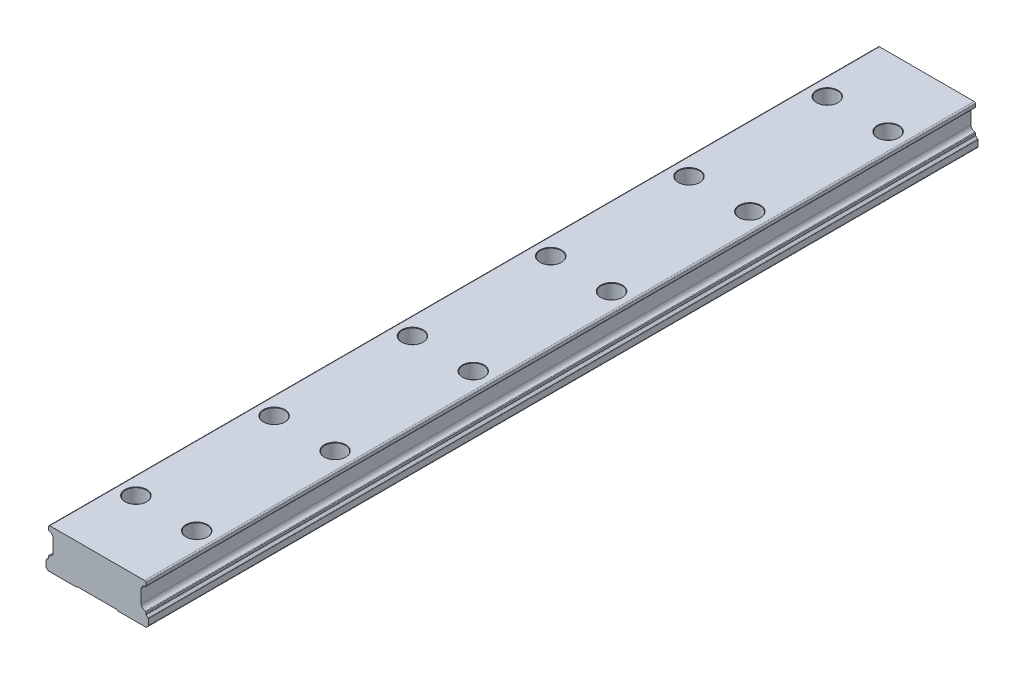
ISO-10303-21;
HEADER;
FILE_DESCRIPTION(('STEP AP214'),'2;1');
FILE_NAME('part.step','',(''),(''),'','','');
FILE_SCHEMA(('AUTOMOTIVE_DESIGN { 1 0 10303 214 1 1 1 1 }'));
ENDSEC;
DATA;
#1=APPLICATION_CONTEXT('core data for automotive mechanical design processes');
#2=APPLICATION_PROTOCOL_DEFINITION('international standard','automotive_design',2000,#1);
#3=PRODUCT_CONTEXT('',#1,'mechanical');
#4=PRODUCT('Part','Part','',(#3));
#5=PRODUCT_RELATED_PRODUCT_CATEGORY('part','',(#4));
#6=PRODUCT_DEFINITION_FORMATION('','',#4);
#7=PRODUCT_DEFINITION_CONTEXT('part definition',#1,'design');
#8=PRODUCT_DEFINITION('design','',#6,#7);
#9=PRODUCT_DEFINITION_SHAPE('','',#8);
#10=(LENGTH_UNIT() NAMED_UNIT(*) SI_UNIT(.MILLI.,.METRE.));
#11=(NAMED_UNIT(*) PLANE_ANGLE_UNIT() SI_UNIT($,.RADIAN.));
#12=(NAMED_UNIT(*) SI_UNIT($,.STERADIAN.) SOLID_ANGLE_UNIT());
#13=UNCERTAINTY_MEASURE_WITH_UNIT(LENGTH_MEASURE(1.E-05),#10,'distance_accuracy_value','');
#14=(GEOMETRIC_REPRESENTATION_CONTEXT(3) GLOBAL_UNCERTAINTY_ASSIGNED_CONTEXT((#13)) GLOBAL_UNIT_ASSIGNED_CONTEXT((#10,
#11,#12)) REPRESENTATION_CONTEXT('',''));
#15=CARTESIAN_POINT('',(0.,0.,0.));
#16=DIRECTION('',(0.,0.,1.));
#17=DIRECTION('',(1.,0.,0.));
#18=AXIS2_PLACEMENT_3D('',#15,#16,#17);
#19=CARTESIAN_POINT('',(17.1,13.9,300.));
#20=DIRECTION('',(0.,0.,-1.));
#21=DIRECTION('',(-1.,0.,0.));
#22=AXIS2_PLACEMENT_3D('',#19,#20,#21);
#23=CYLINDRICAL_SURFACE('',#22,0.500000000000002);
#24=CARTESIAN_POINT('',(17.1,13.9,0.));
#25=DIRECTION('',(0.,0.,1.));
#26=DIRECTION('',(1.,0.,0.));
#27=AXIS2_PLACEMENT_3D('',#24,#25,#26);
#28=CIRCLE('',#27,0.500000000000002);
#29=CARTESIAN_POINT('',(17.6,13.9,0.));
#30=VERTEX_POINT('',#29);
#31=CARTESIAN_POINT('',(17.1,14.4,0.));
#32=VERTEX_POINT('',#31);
#33=EDGE_CURVE('E313',#30,#32,#28,.T.);
#34=ORIENTED_EDGE('',*,*,#33,.T.);
#35=DIRECTION('',(0.,0.,-1.));
#36=VECTOR('',#35,1.);
#37=CARTESIAN_POINT('',(17.1,14.4,300.));
#38=LINE('',#37,#36);
#39=CARTESIAN_POINT('',(17.1,14.4,300.));
#40=VERTEX_POINT('',#39);
#41=EDGE_CURVE('E293',#40,#32,#38,.T.);
#42=ORIENTED_EDGE('',*,*,#41,.F.);
#43=CARTESIAN_POINT('',(17.1,13.9,300.));
#44=DIRECTION('',(0.,0.,1.));
#45=DIRECTION('',(1.,0.,0.));
#46=AXIS2_PLACEMENT_3D('',#43,#44,#45);
#47=CIRCLE('',#46,0.500000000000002);
#48=CARTESIAN_POINT('',(17.6,13.9,300.));
#49=VERTEX_POINT('',#48);
#50=EDGE_CURVE('E300',#49,#40,#47,.T.);
#51=ORIENTED_EDGE('',*,*,#50,.F.);
#52=DIRECTION('',(0.,0.,-1.));
#53=VECTOR('',#52,1.);
#54=CARTESIAN_POINT('',(17.6,13.9,300.));
#55=LINE('',#54,#53);
#56=EDGE_CURVE('E429',#49,#30,#55,.T.);
#57=ORIENTED_EDGE('',*,*,#56,.T.);
#58=EDGE_LOOP('',(#34,#42,#51,#57));
#59=FACE_BOUND('',#58,.T.);
#60=ADVANCED_FACE('F32',(#59),#23,.T.);
#61=CARTESIAN_POINT('',(-17.1,14.4,300.));
#62=DIRECTION('',(0.,-1.,0.));
#63=DIRECTION('',(0.,0.,-1.));
#64=AXIS2_PLACEMENT_3D('',#61,#62,#63);
#65=PLANE('',#64);
#66=CARTESIAN_POINT('',(11.,14.4,275.));
#67=DIRECTION('',(0.,1.,0.));
#68=DIRECTION('',(0.,0.,1.));
#69=AXIS2_PLACEMENT_3D('',#66,#67,#68);
#70=CIRCLE('',#69,3.9);
#71=CARTESIAN_POINT('',(11.,14.4,278.9));
#72=VERTEX_POINT('',#71);
#73=EDGE_CURVE('E1914',#72,#72,#70,.T.);
#74=ORIENTED_EDGE('',*,*,#73,.F.);
#75=EDGE_LOOP('',(#74));
#76=FACE_BOUND('',#75,.T.);
#77=CARTESIAN_POINT('',(-11.,14.4,275.));
#78=DIRECTION('',(0.,1.,0.));
#79=DIRECTION('',(0.,0.,1.));
#80=AXIS2_PLACEMENT_3D('',#77,#78,#79);
#81=CIRCLE('',#80,3.9);
#82=CARTESIAN_POINT('',(-11.,14.4,278.9));
#83=VERTEX_POINT('',#82);
#84=EDGE_CURVE('E1896',#83,#83,#81,.T.);
#85=ORIENTED_EDGE('',*,*,#84,.F.);
#86=EDGE_LOOP('',(#85));
#87=FACE_BOUND('',#86,.T.);
#88=CARTESIAN_POINT('',(11.,14.4,225.));
#89=DIRECTION('',(0.,1.,0.));
#90=DIRECTION('',(0.,0.,1.));
#91=AXIS2_PLACEMENT_3D('',#88,#89,#90);
#92=CIRCLE('',#91,3.9);
#93=CARTESIAN_POINT('',(11.,14.4,228.9));
#94=VERTEX_POINT('',#93);
#95=EDGE_CURVE('E1878',#94,#94,#92,.T.);
#96=ORIENTED_EDGE('',*,*,#95,.F.);
#97=EDGE_LOOP('',(#96));
#98=FACE_BOUND('',#97,.T.);
#99=CARTESIAN_POINT('',(-11.,14.4,225.));
#100=DIRECTION('',(0.,1.,0.));
#101=DIRECTION('',(0.,0.,1.));
#102=AXIS2_PLACEMENT_3D('',#99,#100,#101);
#103=CIRCLE('',#102,3.9);
#104=CARTESIAN_POINT('',(-11.,14.4,228.9));
#105=VERTEX_POINT('',#104);
#106=EDGE_CURVE('E1860',#105,#105,#103,.T.);
#107=ORIENTED_EDGE('',*,*,#106,.F.);
#108=EDGE_LOOP('',(#107));
#109=FACE_BOUND('',#108,.T.);
#110=CARTESIAN_POINT('',(11.,14.4,175.));
#111=DIRECTION('',(0.,1.,0.));
#112=DIRECTION('',(0.,0.,1.));
#113=AXIS2_PLACEMENT_3D('',#110,#111,#112);
#114=CIRCLE('',#113,3.9);
#115=CARTESIAN_POINT('',(11.,14.4,178.9));
#116=VERTEX_POINT('',#115);
#117=EDGE_CURVE('E1842',#116,#116,#114,.T.);
#118=ORIENTED_EDGE('',*,*,#117,.F.);
#119=EDGE_LOOP('',(#118));
#120=FACE_BOUND('',#119,.T.);
#121=CARTESIAN_POINT('',(-11.,14.4,175.));
#122=DIRECTION('',(0.,1.,0.));
#123=DIRECTION('',(0.,0.,1.));
#124=AXIS2_PLACEMENT_3D('',#121,#122,#123);
#125=CIRCLE('',#124,3.9);
#126=CARTESIAN_POINT('',(-11.,14.4,178.9));
#127=VERTEX_POINT('',#126);
#128=EDGE_CURVE('E1824',#127,#127,#125,.T.);
#129=ORIENTED_EDGE('',*,*,#128,.F.);
#130=EDGE_LOOP('',(#129));
#131=FACE_BOUND('',#130,.T.);
#132=CARTESIAN_POINT('',(11.,14.4,125.));
#133=DIRECTION('',(0.,1.,0.));
#134=DIRECTION('',(0.,0.,1.));
#135=AXIS2_PLACEMENT_3D('',#132,#133,#134);
#136=CIRCLE('',#135,3.9);
#137=CARTESIAN_POINT('',(11.,14.4,128.9));
#138=VERTEX_POINT('',#137);
#139=EDGE_CURVE('E1806',#138,#138,#136,.T.);
#140=ORIENTED_EDGE('',*,*,#139,.F.);
#141=EDGE_LOOP('',(#140));
#142=FACE_BOUND('',#141,.T.);
#143=CARTESIAN_POINT('',(-11.,14.4,125.));
#144=DIRECTION('',(0.,1.,0.));
#145=DIRECTION('',(0.,0.,1.));
#146=AXIS2_PLACEMENT_3D('',#143,#144,#145);
#147=CIRCLE('',#146,3.9);
#148=CARTESIAN_POINT('',(-11.,14.4,128.9));
#149=VERTEX_POINT('',#148);
#150=EDGE_CURVE('E1788',#149,#149,#147,.T.);
#151=ORIENTED_EDGE('',*,*,#150,.F.);
#152=EDGE_LOOP('',(#151));
#153=FACE_BOUND('',#152,.T.);
#154=CARTESIAN_POINT('',(11.,14.4,75.));
#155=DIRECTION('',(0.,1.,0.));
#156=DIRECTION('',(0.,0.,1.));
#157=AXIS2_PLACEMENT_3D('',#154,#155,#156);
#158=CIRCLE('',#157,3.9);
#159=CARTESIAN_POINT('',(11.,14.4,78.9));
#160=VERTEX_POINT('',#159);
#161=EDGE_CURVE('E1770',#160,#160,#158,.T.);
#162=ORIENTED_EDGE('',*,*,#161,.F.);
#163=EDGE_LOOP('',(#162));
#164=FACE_BOUND('',#163,.T.);
#165=CARTESIAN_POINT('',(-11.,14.4,75.));
#166=DIRECTION('',(0.,1.,0.));
#167=DIRECTION('',(0.,0.,1.));
#168=AXIS2_PLACEMENT_3D('',#165,#166,#167);
#169=CIRCLE('',#168,3.9);
#170=CARTESIAN_POINT('',(-11.,14.4,78.9));
#171=VERTEX_POINT('',#170);
#172=EDGE_CURVE('E1752',#171,#171,#169,.T.);
#173=ORIENTED_EDGE('',*,*,#172,.F.);
#174=EDGE_LOOP('',(#173));
#175=FACE_BOUND('',#174,.T.);
#176=CARTESIAN_POINT('',(11.,14.4,25.));
#177=DIRECTION('',(0.,1.,0.));
#178=DIRECTION('',(0.,0.,1.));
#179=AXIS2_PLACEMENT_3D('',#176,#177,#178);
#180=CIRCLE('',#179,3.9);
#181=CARTESIAN_POINT('',(11.,14.4,28.9));
#182=VERTEX_POINT('',#181);
#183=EDGE_CURVE('E1734',#182,#182,#180,.T.);
#184=ORIENTED_EDGE('',*,*,#183,.F.);
#185=EDGE_LOOP('',(#184));
#186=FACE_BOUND('',#185,.T.);
#187=CARTESIAN_POINT('',(-11.,14.4,25.));
#188=DIRECTION('',(0.,1.,0.));
#189=DIRECTION('',(0.,0.,1.));
#190=AXIS2_PLACEMENT_3D('',#187,#188,#189);
#191=CIRCLE('',#190,3.9);
#192=CARTESIAN_POINT('',(-11.,14.4,28.9));
#193=VERTEX_POINT('',#192);
#194=EDGE_CURVE('E1716',#193,#193,#191,.T.);
#195=ORIENTED_EDGE('',*,*,#194,.F.);
#196=EDGE_LOOP('',(#195));
#197=FACE_BOUND('',#196,.T.);
#198=DIRECTION('',(-1.,0.,0.));
#199=VECTOR('',#198,1.);
#200=CARTESIAN_POINT('',(-17.1,14.4,0.));
#201=LINE('',#200,#199);
#202=CARTESIAN_POINT('',(-17.1,14.4,0.));
#203=VERTEX_POINT('',#202);
#204=EDGE_CURVE('E520',#32,#203,#201,.T.);
#205=ORIENTED_EDGE('',*,*,#204,.T.);
#206=DIRECTION('',(0.,0.,-1.));
#207=VECTOR('',#206,1.);
#208=CARTESIAN_POINT('',(-17.1,14.4,300.));
#209=LINE('',#208,#207);
#210=CARTESIAN_POINT('',(-17.1,14.4,300.));
#211=VERTEX_POINT('',#210);
#212=EDGE_CURVE('E296',#211,#203,#209,.T.);
#213=ORIENTED_EDGE('',*,*,#212,.F.);
#214=DIRECTION('',(-1.,0.,0.));
#215=VECTOR('',#214,1.);
#216=CARTESIAN_POINT('',(-17.1,14.4,300.));
#217=LINE('',#216,#215);
#218=EDGE_CURVE('E289',#40,#211,#217,.T.);
#219=ORIENTED_EDGE('',*,*,#218,.F.);
#220=ORIENTED_EDGE('',*,*,#41,.T.);
#221=EDGE_LOOP('',(#205,#213,#219,#220));
#222=FACE_BOUND('',#221,.T.);
#223=ADVANCED_FACE('F291',(#76,#87,#98,#109,#120,#131,#142,#153,#164,#175,#186,#197,#222),#65,.F.);
#224=CARTESIAN_POINT('',(-17.1,13.9,300.));
#225=DIRECTION('',(0.,0.,-1.));
#226=DIRECTION('',(-1.,0.,0.));
#227=AXIS2_PLACEMENT_3D('',#224,#225,#226);
#228=CYLINDRICAL_SURFACE('',#227,0.500000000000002);
#229=CARTESIAN_POINT('',(-17.1,13.9,0.));
#230=DIRECTION('',(0.,0.,1.));
#231=DIRECTION('',(-1.,0.,0.));
#232=AXIS2_PLACEMENT_3D('',#229,#230,#231);
#233=CIRCLE('',#232,0.500000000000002);
#234=CARTESIAN_POINT('',(-17.6,13.9,0.));
#235=VERTEX_POINT('',#234);
#236=EDGE_CURVE('E514',#203,#235,#233,.T.);
#237=ORIENTED_EDGE('',*,*,#236,.T.);
#238=DIRECTION('',(0.,0.,-1.));
#239=VECTOR('',#238,1.);
#240=CARTESIAN_POINT('',(-17.6,13.9,300.));
#241=LINE('',#240,#239);
#242=CARTESIAN_POINT('',(-17.6,13.9,300.));
#243=VERTEX_POINT('',#242);
#244=EDGE_CURVE('E319',#243,#235,#241,.T.);
#245=ORIENTED_EDGE('',*,*,#244,.F.);
#246=CARTESIAN_POINT('',(-17.1,13.9,300.));
#247=DIRECTION('',(0.,0.,1.));
#248=DIRECTION('',(-1.,0.,0.));
#249=AXIS2_PLACEMENT_3D('',#246,#247,#248);
#250=CIRCLE('',#249,0.500000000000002);
#251=EDGE_CURVE('E299',#211,#243,#250,.T.);
#252=ORIENTED_EDGE('',*,*,#251,.F.);
#253=ORIENTED_EDGE('',*,*,#212,.T.);
#254=EDGE_LOOP('',(#237,#245,#252,#253));
#255=FACE_BOUND('',#254,.T.);
#256=ADVANCED_FACE('F594',(#255),#228,.T.);
#257=CARTESIAN_POINT('',(-17.6,12.8958557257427,300.));
#258=DIRECTION('',(1.,0.,0.));
#259=DIRECTION('',(0.,1.,0.));
#260=AXIS2_PLACEMENT_3D('',#257,#258,#259);
#261=PLANE('',#260);
#262=DIRECTION('',(0.,-1.,0.));
#263=VECTOR('',#262,1.);
#264=CARTESIAN_POINT('',(-17.6,12.8958557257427,0.));
#265=LINE('',#264,#263);
#266=CARTESIAN_POINT('',(-17.6,12.8958557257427,0.));
#267=VERTEX_POINT('',#266);
#268=EDGE_CURVE('E509',#235,#267,#265,.T.);
#269=ORIENTED_EDGE('',*,*,#268,.T.);
#270=DIRECTION('',(0.,0.,-1.));
#271=VECTOR('',#270,1.);
#272=CARTESIAN_POINT('',(-17.6,12.8958557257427,300.));
#273=LINE('',#272,#271);
#274=CARTESIAN_POINT('',(-17.6,12.8958557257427,300.));
#275=VERTEX_POINT('',#274);
#276=EDGE_CURVE('E500',#275,#267,#273,.T.);
#277=ORIENTED_EDGE('',*,*,#276,.F.);
#278=DIRECTION('',(0.,-1.,0.));
#279=VECTOR('',#278,1.);
#280=CARTESIAN_POINT('',(-17.6,12.8958557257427,300.));
#281=LINE('',#280,#279);
#282=EDGE_CURVE('E510',#243,#275,#281,.T.);
#283=ORIENTED_EDGE('',*,*,#282,.F.);
#284=ORIENTED_EDGE('',*,*,#244,.T.);
#285=EDGE_LOOP('',(#269,#277,#283,#284));
#286=FACE_BOUND('',#285,.T.);
#287=ADVANCED_FACE('F507',(#286),#261,.F.);
#288=CARTESIAN_POINT('',(-17.35,12.8958557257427,300.));
#289=DIRECTION('',(0.,0.,-1.));
#290=DIRECTION('',(-1.,0.,0.));
#291=AXIS2_PLACEMENT_3D('',#288,#289,#290);
#292=CYLINDRICAL_SURFACE('',#291,0.25);
#293=CARTESIAN_POINT('',(-17.35,12.8958557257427,0.));
#294=DIRECTION('',(0.,0.,1.));
#295=DIRECTION('',(-1.,0.,0.));
#296=AXIS2_PLACEMENT_3D('',#293,#294,#295);
#297=CIRCLE('',#296,0.25);
#298=CARTESIAN_POINT('',(-17.3755518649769,12.6471649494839,0.));
#299=VERTEX_POINT('',#298);
#300=EDGE_CURVE('E516',#267,#299,#297,.T.);
#301=ORIENTED_EDGE('',*,*,#300,.T.);
#302=DIRECTION('',(0.,0.,-1.));
#303=VECTOR('',#302,1.);
#304=CARTESIAN_POINT('',(-17.3755518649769,12.6471649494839,300.));
#305=LINE('',#304,#303);
#306=CARTESIAN_POINT('',(-17.3755518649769,12.6471649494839,300.));
#307=VERTEX_POINT('',#306);
#308=EDGE_CURVE('E497',#307,#299,#305,.T.);
#309=ORIENTED_EDGE('',*,*,#308,.F.);
#310=CARTESIAN_POINT('',(-17.35,12.8958557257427,300.));
#311=DIRECTION('',(0.,0.,1.));
#312=DIRECTION('',(-1.,0.,0.));
#313=AXIS2_PLACEMENT_3D('',#310,#311,#312);
#314=CIRCLE('',#313,0.25);
#315=EDGE_CURVE('E596',#275,#307,#314,.T.);
#316=ORIENTED_EDGE('',*,*,#315,.F.);
#317=ORIENTED_EDGE('',*,*,#276,.T.);
#318=EDGE_LOOP('',(#301,#309,#316,#317));
#319=FACE_BOUND('',#318,.T.);
#320=ADVANCED_FACE('F680',(#319),#292,.T.);
#321=CARTESIAN_POINT('',(-17.5441941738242,11.0058058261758,300.));
#322=DIRECTION('',(0.,0.,-1.));
#323=DIRECTION('',(-1.,0.,0.));
#324=AXIS2_PLACEMENT_3D('',#321,#322,#323);
#325=CYLINDRICAL_SURFACE('',#324,1.65);
#326=CARTESIAN_POINT('',(-17.5441941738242,11.0058058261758,0.));
#327=DIRECTION('',(0.,0.,-1.));
#328=DIRECTION('',(1.,0.,0.));
#329=AXIS2_PLACEMENT_3D('',#326,#327,#328);
#330=CIRCLE('',#329,1.65);
#331=CARTESIAN_POINT('',(-15.9108735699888,11.239822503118,0.));
#332=VERTEX_POINT('',#331);
#333=EDGE_CURVE('E518',#299,#332,#330,.T.);
#334=ORIENTED_EDGE('',*,*,#333,.T.);
#335=DIRECTION('',(0.,0.,-1.));
#336=VECTOR('',#335,1.);
#337=CARTESIAN_POINT('',(-15.9108735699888,11.239822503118,300.));
#338=LINE('',#337,#336);
#339=CARTESIAN_POINT('',(-15.9108735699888,11.239822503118,300.));
#340=VERTEX_POINT('',#339);
#341=EDGE_CURVE('E494',#340,#332,#338,.T.);
#342=ORIENTED_EDGE('',*,*,#341,.F.);
#343=CARTESIAN_POINT('',(-17.5441941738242,11.0058058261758,300.));
#344=DIRECTION('',(0.,0.,-1.));
#345=DIRECTION('',(1.,0.,0.));
#346=AXIS2_PLACEMENT_3D('',#343,#344,#345);
#347=CIRCLE('',#346,1.65);
#348=EDGE_CURVE('E600',#307,#340,#347,.T.);
#349=ORIENTED_EDGE('',*,*,#348,.F.);
#350=ORIENTED_EDGE('',*,*,#308,.T.);
#351=EDGE_LOOP('',(#334,#342,#349,#350));
#352=FACE_BOUND('',#351,.T.);
#353=ADVANCED_FACE('F676',(#352),#325,.F.);
#354=CARTESIAN_POINT('',(-15.9108735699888,11.239822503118,300.));
#355=DIRECTION('',(1.,0.,0.));
#356=DIRECTION('',(0.,0.,-1.));
#357=AXIS2_PLACEMENT_3D('',#354,#355,#356);
#358=PLANE('',#357);
#359=DIRECTION('',(0.,-1.,0.));
#360=VECTOR('',#359,1.);
#361=CARTESIAN_POINT('',(-15.9108735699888,11.239822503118,0.));
#362=LINE('',#361,#360);
#363=CARTESIAN_POINT('',(-15.9108735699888,6.36017749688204,0.));
#364=VERTEX_POINT('',#363);
#365=EDGE_CURVE('E525',#332,#364,#362,.T.);
#366=ORIENTED_EDGE('',*,*,#365,.T.);
#367=DIRECTION('',(0.,0.,-1.));
#368=VECTOR('',#367,1.);
#369=CARTESIAN_POINT('',(-15.9108735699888,6.36017749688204,300.));
#370=LINE('',#369,#368);
#371=CARTESIAN_POINT('',(-15.9108735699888,6.36017749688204,300.));
#372=VERTEX_POINT('',#371);
#373=EDGE_CURVE('E491',#372,#364,#370,.T.);
#374=ORIENTED_EDGE('',*,*,#373,.F.);
#375=DIRECTION('',(0.,-1.,0.));
#376=VECTOR('',#375,1.);
#377=CARTESIAN_POINT('',(-15.9108735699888,11.239822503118,300.));
#378=LINE('',#377,#376);
#379=EDGE_CURVE('E602',#340,#372,#378,.T.);
#380=ORIENTED_EDGE('',*,*,#379,.F.);
#381=ORIENTED_EDGE('',*,*,#341,.T.);
#382=EDGE_LOOP('',(#366,#374,#380,#381));
#383=FACE_BOUND('',#382,.T.);
#384=ADVANCED_FACE('F672',(#383),#358,.F.);
#385=CARTESIAN_POINT('',(-17.5441941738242,6.59419417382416,300.));
#386=DIRECTION('',(0.,0.,-1.));
#387=DIRECTION('',(-1.,0.,0.));
#388=AXIS2_PLACEMENT_3D('',#385,#386,#387);
#389=CYLINDRICAL_SURFACE('',#388,1.65);
#390=CARTESIAN_POINT('',(-17.5441941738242,6.59419417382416,0.));
#391=DIRECTION('',(0.,0.,-1.));
#392=DIRECTION('',(1.,0.,0.));
#393=AXIS2_PLACEMENT_3D('',#390,#391,#392);
#394=CIRCLE('',#393,1.65);
#395=CARTESIAN_POINT('',(-17.3755518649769,4.95283505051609,0.));
#396=VERTEX_POINT('',#395);
#397=EDGE_CURVE('E527',#364,#396,#394,.T.);
#398=ORIENTED_EDGE('',*,*,#397,.T.);
#399=DIRECTION('',(0.,0.,-1.));
#400=VECTOR('',#399,1.);
#401=CARTESIAN_POINT('',(-17.3755518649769,4.95283505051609,300.));
#402=LINE('',#401,#400);
#403=CARTESIAN_POINT('',(-17.3755518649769,4.95283505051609,300.));
#404=VERTEX_POINT('',#403);
#405=EDGE_CURVE('E488',#404,#396,#402,.T.);
#406=ORIENTED_EDGE('',*,*,#405,.F.);
#407=CARTESIAN_POINT('',(-17.5441941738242,6.59419417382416,300.));
#408=DIRECTION('',(0.,0.,-1.));
#409=DIRECTION('',(1.,0.,0.));
#410=AXIS2_PLACEMENT_3D('',#407,#408,#409);
#411=CIRCLE('',#410,1.65);
#412=EDGE_CURVE('E604',#372,#404,#411,.T.);
#413=ORIENTED_EDGE('',*,*,#412,.F.);
#414=ORIENTED_EDGE('',*,*,#373,.T.);
#415=EDGE_LOOP('',(#398,#406,#413,#414));
#416=FACE_BOUND('',#415,.T.);
#417=ADVANCED_FACE('F667',(#416),#389,.F.);
#418=CARTESIAN_POINT('',(-17.35,4.70414427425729,300.));
#419=DIRECTION('',(0.,0.,-1.));
#420=DIRECTION('',(-1.,0.,0.));
#421=AXIS2_PLACEMENT_3D('',#418,#419,#420);
#422=CYLINDRICAL_SURFACE('',#421,0.25);
#423=CARTESIAN_POINT('',(-17.35,4.70414427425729,0.));
#424=DIRECTION('',(0.,0.,1.));
#425=DIRECTION('',(1.,0.,0.));
#426=AXIS2_PLACEMENT_3D('',#423,#424,#425);
#427=CIRCLE('',#426,0.25);
#428=CARTESIAN_POINT('',(-17.6,4.70414427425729,0.));
#429=VERTEX_POINT('',#428);
#430=EDGE_CURVE('E529',#396,#429,#427,.T.);
#431=ORIENTED_EDGE('',*,*,#430,.T.);
#432=DIRECTION('',(0.,0.,-1.));
#433=VECTOR('',#432,1.);
#434=CARTESIAN_POINT('',(-17.6,4.70414427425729,300.));
#435=LINE('',#434,#433);
#436=CARTESIAN_POINT('',(-17.6,4.70414427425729,300.));
#437=VERTEX_POINT('',#436);
#438=EDGE_CURVE('E485',#437,#429,#435,.T.);
#439=ORIENTED_EDGE('',*,*,#438,.F.);
#440=CARTESIAN_POINT('',(-17.35,4.70414427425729,300.));
#441=DIRECTION('',(0.,0.,1.));
#442=DIRECTION('',(1.,0.,0.));
#443=AXIS2_PLACEMENT_3D('',#440,#441,#442);
#444=CIRCLE('',#443,0.25);
#445=EDGE_CURVE('E606',#404,#437,#444,.T.);
#446=ORIENTED_EDGE('',*,*,#445,.F.);
#447=ORIENTED_EDGE('',*,*,#405,.T.);
#448=EDGE_LOOP('',(#431,#439,#446,#447));
#449=FACE_BOUND('',#448,.T.);
#450=ADVANCED_FACE('F662',(#449),#422,.T.);
#451=CARTESIAN_POINT('',(-17.6,4.70414427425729,300.));
#452=DIRECTION('',(1.,0.,0.));
#453=DIRECTION('',(0.,1.,0.));
#454=AXIS2_PLACEMENT_3D('',#451,#452,#453);
#455=PLANE('',#454);
#456=DIRECTION('',(0.,-1.,0.));
#457=VECTOR('',#456,1.);
#458=CARTESIAN_POINT('',(-17.6,4.70414427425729,0.));
#459=LINE('',#458,#457);
#460=CARTESIAN_POINT('',(-17.6,4.06657691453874,0.));
#461=VERTEX_POINT('',#460);
#462=EDGE_CURVE('E531',#429,#461,#459,.T.);
#463=ORIENTED_EDGE('',*,*,#462,.T.);
#464=DIRECTION('',(0.,0.,-1.));
#465=VECTOR('',#464,1.);
#466=CARTESIAN_POINT('',(-17.6,4.06657691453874,300.));
#467=LINE('',#466,#465);
#468=CARTESIAN_POINT('',(-17.6,4.06657691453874,300.));
#469=VERTEX_POINT('',#468);
#470=EDGE_CURVE('E482',#469,#461,#467,.T.);
#471=ORIENTED_EDGE('',*,*,#470,.F.);
#472=DIRECTION('',(0.,-1.,0.));
#473=VECTOR('',#472,1.);
#474=CARTESIAN_POINT('',(-17.6,4.70414427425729,300.));
#475=LINE('',#474,#473);
#476=EDGE_CURVE('E608',#437,#469,#475,.T.);
#477=ORIENTED_EDGE('',*,*,#476,.F.);
#478=ORIENTED_EDGE('',*,*,#438,.T.);
#479=EDGE_LOOP('',(#463,#471,#477,#478));
#480=FACE_BOUND('',#479,.T.);
#481=ADVANCED_FACE('F658',(#480),#455,.F.);
#482=CARTESIAN_POINT('',(-17.85,4.06657691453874,300.));
#483=DIRECTION('',(0.,0.,-1.));
#484=DIRECTION('',(-1.,0.,0.));
#485=AXIS2_PLACEMENT_3D('',#482,#483,#484);
#486=CYLINDRICAL_SURFACE('',#485,0.249999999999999);
#487=CARTESIAN_POINT('',(-17.85,4.06657691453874,0.));
#488=DIRECTION('',(0.,0.,-1.));
#489=DIRECTION('',(1.,0.,0.));
#490=AXIS2_PLACEMENT_3D('',#487,#488,#489);
#491=CIRCLE('',#490,0.249999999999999);
#492=CARTESIAN_POINT('',(-17.6893030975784,3.875065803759,0.));
#493=VERTEX_POINT('',#492);
#494=EDGE_CURVE('E533',#461,#493,#491,.T.);
#495=ORIENTED_EDGE('',*,*,#494,.T.);
#496=DIRECTION('',(0.,0.,-1.));
#497=VECTOR('',#496,1.);
#498=CARTESIAN_POINT('',(-17.6893030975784,3.875065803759,300.));
#499=LINE('',#498,#497);
#500=CARTESIAN_POINT('',(-17.6893030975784,3.875065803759,300.));
#501=VERTEX_POINT('',#500);
#502=EDGE_CURVE('E479',#501,#493,#499,.T.);
#503=ORIENTED_EDGE('',*,*,#502,.F.);
#504=CARTESIAN_POINT('',(-17.85,4.06657691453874,300.));
#505=DIRECTION('',(0.,0.,-1.));
#506=DIRECTION('',(1.,0.,0.));
#507=AXIS2_PLACEMENT_3D('',#504,#505,#506);
#508=CIRCLE('',#507,0.249999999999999);
#509=EDGE_CURVE('E610',#469,#501,#508,.T.);
#510=ORIENTED_EDGE('',*,*,#509,.F.);
#511=ORIENTED_EDGE('',*,*,#470,.T.);
#512=EDGE_LOOP('',(#495,#503,#510,#511));
#513=FACE_BOUND('',#512,.T.);
#514=ADVANCED_FACE('F653',(#513),#486,.F.);
#515=CARTESIAN_POINT('',(-17.6893030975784,3.875065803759,300.));
#516=DIRECTION('',(0.642787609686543,-0.766044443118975,0.));
#517=DIRECTION('',(0.766044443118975,0.642787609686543,0.));
#518=AXIS2_PLACEMENT_3D('',#515,#516,#517);
#519=PLANE('',#518);
#520=DIRECTION('',(-0.766044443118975,-0.642787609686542,0.));
#521=VECTOR('',#520,1.);
#522=CARTESIAN_POINT('',(-17.6893030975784,3.875065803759,0.));
#523=LINE('',#522,#521);
#524=CARTESIAN_POINT('',(-18.4106969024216,3.26974452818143,0.));
#525=VERTEX_POINT('',#524);
#526=EDGE_CURVE('E535',#493,#525,#523,.T.);
#527=ORIENTED_EDGE('',*,*,#526,.T.);
#528=DIRECTION('',(0.,0.,-1.));
#529=VECTOR('',#528,1.);
#530=CARTESIAN_POINT('',(-18.4106969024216,3.26974452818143,300.));
#531=LINE('',#530,#529);
#532=CARTESIAN_POINT('',(-18.4106969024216,3.26974452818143,300.));
#533=VERTEX_POINT('',#532);
#534=EDGE_CURVE('E476',#533,#525,#531,.T.);
#535=ORIENTED_EDGE('',*,*,#534,.F.);
#536=DIRECTION('',(-0.766044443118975,-0.642787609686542,0.));
#537=VECTOR('',#536,1.);
#538=CARTESIAN_POINT('',(-17.6893030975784,3.875065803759,300.));
#539=LINE('',#538,#537);
#540=EDGE_CURVE('E612',#501,#533,#539,.T.);
#541=ORIENTED_EDGE('',*,*,#540,.F.);
#542=ORIENTED_EDGE('',*,*,#502,.T.);
#543=EDGE_LOOP('',(#527,#535,#541,#542));
#544=FACE_BOUND('',#543,.T.);
#545=ADVANCED_FACE('F647',(#544),#519,.F.);
#546=CARTESIAN_POINT('',(-18.25,3.07823341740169,300.));
#547=DIRECTION('',(0.,0.,-1.));
#548=DIRECTION('',(-1.,0.,0.));
#549=AXIS2_PLACEMENT_3D('',#546,#547,#548);
#550=CYLINDRICAL_SURFACE('',#549,0.25);
#551=CARTESIAN_POINT('',(-18.25,3.07823341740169,0.));
#552=DIRECTION('',(0.,0.,1.));
#553=DIRECTION('',(-1.,0.,0.));
#554=AXIS2_PLACEMENT_3D('',#551,#552,#553);
#555=CIRCLE('',#554,0.25);
#556=CARTESIAN_POINT('',(-18.5,3.07823341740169,0.));
#557=VERTEX_POINT('',#556);
#558=EDGE_CURVE('E537',#525,#557,#555,.T.);
#559=ORIENTED_EDGE('',*,*,#558,.T.);
#560=DIRECTION('',(0.,0.,-1.));
#561=VECTOR('',#560,1.);
#562=CARTESIAN_POINT('',(-18.5,3.07823341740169,300.));
#563=LINE('',#562,#561);
#564=CARTESIAN_POINT('',(-18.5,3.07823341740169,300.));
#565=VERTEX_POINT('',#564);
#566=EDGE_CURVE('E473',#565,#557,#563,.T.);
#567=ORIENTED_EDGE('',*,*,#566,.F.);
#568=CARTESIAN_POINT('',(-18.25,3.07823341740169,300.));
#569=DIRECTION('',(0.,0.,1.));
#570=DIRECTION('',(-1.,0.,0.));
#571=AXIS2_PLACEMENT_3D('',#568,#569,#570);
#572=CIRCLE('',#571,0.25);
#573=EDGE_CURVE('E614',#533,#565,#572,.T.);
#574=ORIENTED_EDGE('',*,*,#573,.F.);
#575=ORIENTED_EDGE('',*,*,#534,.T.);
#576=EDGE_LOOP('',(#559,#567,#574,#575));
#577=FACE_BOUND('',#576,.T.);
#578=ADVANCED_FACE('F643',(#577),#550,.T.);
#579=CARTESIAN_POINT('',(-18.5,0.957106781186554,300.));
#580=DIRECTION('',(1.,0.,0.));
#581=DIRECTION('',(0.,0.,-1.));
#582=AXIS2_PLACEMENT_3D('',#579,#580,#581);
#583=PLANE('',#582);
#584=DIRECTION('',(0.,-1.,0.));
#585=VECTOR('',#584,1.);
#586=CARTESIAN_POINT('',(-18.5,0.957106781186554,0.));
#587=LINE('',#586,#585);
#588=CARTESIAN_POINT('',(-18.5,0.957106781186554,0.));
#589=VERTEX_POINT('',#588);
#590=EDGE_CURVE('E539',#557,#589,#587,.T.);
#591=ORIENTED_EDGE('',*,*,#590,.T.);
#592=DIRECTION('',(0.,0.,-1.));
#593=VECTOR('',#592,1.);
#594=CARTESIAN_POINT('',(-18.5,0.957106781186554,300.));
#595=LINE('',#594,#593);
#596=CARTESIAN_POINT('',(-18.5,0.957106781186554,300.));
#597=VERTEX_POINT('',#596);
#598=EDGE_CURVE('E470',#597,#589,#595,.T.);
#599=ORIENTED_EDGE('',*,*,#598,.F.);
#600=DIRECTION('',(0.,-1.,0.));
#601=VECTOR('',#600,1.);
#602=CARTESIAN_POINT('',(-18.5,0.957106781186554,300.));
#603=LINE('',#602,#601);
#604=EDGE_CURVE('E616',#565,#597,#603,.T.);
#605=ORIENTED_EDGE('',*,*,#604,.F.);
#606=ORIENTED_EDGE('',*,*,#566,.T.);
#607=EDGE_LOOP('',(#591,#599,#605,#606));
#608=FACE_BOUND('',#607,.T.);
#609=ADVANCED_FACE('F638',(#608),#583,.F.);
#610=CARTESIAN_POINT('',(-18.,0.957106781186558,300.));
#611=DIRECTION('',(0.,0.,-1.));
#612=DIRECTION('',(-1.,0.,0.));
#613=AXIS2_PLACEMENT_3D('',#610,#611,#612);
#614=CYLINDRICAL_SURFACE('',#613,0.500000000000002);
#615=CARTESIAN_POINT('',(-18.,0.957106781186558,0.));
#616=DIRECTION('',(0.,0.,1.));
#617=DIRECTION('',(-1.,0.,0.));
#618=AXIS2_PLACEMENT_3D('',#615,#616,#617);
#619=CIRCLE('',#618,0.500000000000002);
#620=CARTESIAN_POINT('',(-18.3535533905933,0.603553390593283,0.));
#621=VERTEX_POINT('',#620);
#622=EDGE_CURVE('E541',#589,#621,#619,.T.);
#623=ORIENTED_EDGE('',*,*,#622,.T.);
#624=DIRECTION('',(0.,0.,-1.));
#625=VECTOR('',#624,1.);
#626=CARTESIAN_POINT('',(-18.3535533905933,0.603553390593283,300.));
#627=LINE('',#626,#625);
#628=CARTESIAN_POINT('',(-18.3535533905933,0.603553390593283,300.));
#629=VERTEX_POINT('',#628);
#630=EDGE_CURVE('E467',#629,#621,#627,.T.);
#631=ORIENTED_EDGE('',*,*,#630,.F.);
#632=CARTESIAN_POINT('',(-18.,0.957106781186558,300.));
#633=DIRECTION('',(0.,0.,1.));
#634=DIRECTION('',(-1.,0.,0.));
#635=AXIS2_PLACEMENT_3D('',#632,#633,#634);
#636=CIRCLE('',#635,0.500000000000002);
#637=EDGE_CURVE('E618',#597,#629,#636,.T.);
#638=ORIENTED_EDGE('',*,*,#637,.F.);
#639=ORIENTED_EDGE('',*,*,#598,.T.);
#640=EDGE_LOOP('',(#623,#631,#638,#639));
#641=FACE_BOUND('',#640,.T.);
#642=ADVANCED_FACE('F632',(#641),#614,.T.);
#643=CARTESIAN_POINT('',(-18.3535533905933,0.603553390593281,300.));
#644=DIRECTION('',(0.70710678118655,0.707106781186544,0.));
#645=DIRECTION('',(-0.707106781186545,0.707106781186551,0.));
#646=AXIS2_PLACEMENT_3D('',#643,#644,#645);
#647=PLANE('',#646);
#648=DIRECTION('',(0.707106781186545,-0.707106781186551,0.));
#649=VECTOR('',#648,1.);
#650=CARTESIAN_POINT('',(-18.3535533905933,0.603553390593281,0.));
#651=LINE('',#650,#649);
#652=CARTESIAN_POINT('',(-17.8232233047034,0.0732233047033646,0.));
#653=VERTEX_POINT('',#652);
#654=EDGE_CURVE('E543',#621,#653,#651,.T.);
#655=ORIENTED_EDGE('',*,*,#654,.T.);
#656=DIRECTION('',(0.,0.,-1.));
#657=VECTOR('',#656,1.);
#658=CARTESIAN_POINT('',(-17.8232233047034,0.0732233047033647,300.));
#659=LINE('',#658,#657);
#660=CARTESIAN_POINT('',(-17.8232233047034,0.0732233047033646,300.));
#661=VERTEX_POINT('',#660);
#662=EDGE_CURVE('E355',#653,#661,#659,.F.);
#663=ORIENTED_EDGE('',*,*,#662,.T.);
#664=DIRECTION('',(0.707106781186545,-0.707106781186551,0.));
#665=VECTOR('',#664,1.);
#666=CARTESIAN_POINT('',(-18.3535533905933,0.603553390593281,300.));
#667=LINE('',#666,#665);
#668=EDGE_CURVE('E563',#629,#661,#667,.T.);
#669=ORIENTED_EDGE('',*,*,#668,.F.);
#670=ORIENTED_EDGE('',*,*,#630,.T.);
#671=EDGE_LOOP('',(#655,#663,#669,#670));
#672=FACE_BOUND('',#671,.T.);
#673=ADVANCED_FACE('F630',(#672),#647,.F.);
#674=CARTESIAN_POINT('',(-17.75,0.,300.));
#675=DIRECTION('',(0.,1.,0.));
#676=DIRECTION('',(0.,0.,1.));
#677=AXIS2_PLACEMENT_3D('',#674,#675,#676);
#678=PLANE('',#677);
#679=CARTESIAN_POINT('',(-11.,0.,275.));
#680=DIRECTION('',(0.,1.,0.));
#681=DIRECTION('',(0.,0.,1.));
#682=AXIS2_PLACEMENT_3D('',#679,#680,#681);
#683=CIRCLE('',#682,2.5);
#684=CARTESIAN_POINT('',(-11.,0.,277.5));
#685=VERTEX_POINT('',#684);
#686=EDGE_CURVE('E1881',#685,#685,#683,.T.);
#687=ORIENTED_EDGE('',*,*,#686,.T.);
#688=EDGE_LOOP('',(#687));
#689=FACE_BOUND('',#688,.T.);
#690=CARTESIAN_POINT('',(-11.,0.,225.));
#691=DIRECTION('',(0.,1.,0.));
#692=DIRECTION('',(0.,0.,1.));
#693=AXIS2_PLACEMENT_3D('',#690,#691,#692);
#694=CIRCLE('',#693,2.5);
#695=CARTESIAN_POINT('',(-11.,0.,227.5));
#696=VERTEX_POINT('',#695);
#697=EDGE_CURVE('E1845',#696,#696,#694,.T.);
#698=ORIENTED_EDGE('',*,*,#697,.T.);
#699=EDGE_LOOP('',(#698));
#700=FACE_BOUND('',#699,.T.);
#701=CARTESIAN_POINT('',(-11.,0.,175.));
#702=DIRECTION('',(0.,1.,0.));
#703=DIRECTION('',(0.,0.,1.));
#704=AXIS2_PLACEMENT_3D('',#701,#702,#703);
#705=CIRCLE('',#704,2.5);
#706=CARTESIAN_POINT('',(-11.,0.,177.5));
#707=VERTEX_POINT('',#706);
#708=EDGE_CURVE('E1809',#707,#707,#705,.T.);
#709=ORIENTED_EDGE('',*,*,#708,.T.);
#710=EDGE_LOOP('',(#709));
#711=FACE_BOUND('',#710,.T.);
#712=CARTESIAN_POINT('',(-11.,0.,125.));
#713=DIRECTION('',(0.,1.,0.));
#714=DIRECTION('',(0.,0.,1.));
#715=AXIS2_PLACEMENT_3D('',#712,#713,#714);
#716=CIRCLE('',#715,2.5);
#717=CARTESIAN_POINT('',(-11.,0.,127.5));
#718=VERTEX_POINT('',#717);
#719=EDGE_CURVE('E1773',#718,#718,#716,.T.);
#720=ORIENTED_EDGE('',*,*,#719,.T.);
#721=EDGE_LOOP('',(#720));
#722=FACE_BOUND('',#721,.T.);
#723=CARTESIAN_POINT('',(-11.,0.,75.));
#724=DIRECTION('',(0.,1.,0.));
#725=DIRECTION('',(0.,0.,1.));
#726=AXIS2_PLACEMENT_3D('',#723,#724,#725);
#727=CIRCLE('',#726,2.5);
#728=CARTESIAN_POINT('',(-11.,0.,77.5));
#729=VERTEX_POINT('',#728);
#730=EDGE_CURVE('E1737',#729,#729,#727,.T.);
#731=ORIENTED_EDGE('',*,*,#730,.T.);
#732=EDGE_LOOP('',(#731));
#733=FACE_BOUND('',#732,.T.);
#734=CARTESIAN_POINT('',(-11.,0.,25.));
#735=DIRECTION('',(0.,1.,0.));
#736=DIRECTION('',(0.,0.,1.));
#737=AXIS2_PLACEMENT_3D('',#734,#735,#736);
#738=CIRCLE('',#737,2.5);
#739=CARTESIAN_POINT('',(-11.,0.,27.5));
#740=VERTEX_POINT('',#739);
#741=EDGE_CURVE('E593',#740,#740,#738,.T.);
#742=ORIENTED_EDGE('',*,*,#741,.T.);
#743=EDGE_LOOP('',(#742));
#744=FACE_BOUND('',#743,.T.);
#745=DIRECTION('',(1.,0.,0.));
#746=VECTOR('',#745,1.);
#747=CARTESIAN_POINT('',(-17.75,0.,0.));
#748=LINE('',#747,#746);
#749=CARTESIAN_POINT('',(-17.6464466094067,0.,0.));
#750=VERTEX_POINT('',#749);
#751=CARTESIAN_POINT('',(-7.60355339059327,0.,0.));
#752=VERTEX_POINT('',#751);
#753=EDGE_CURVE('E398',#750,#752,#748,.T.);
#754=ORIENTED_EDGE('',*,*,#753,.T.);
#755=DIRECTION('',(0.,0.,-1.));
#756=VECTOR('',#755,1.);
#757=CARTESIAN_POINT('',(-7.60355339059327,0.,300.));
#758=LINE('',#757,#756);
#759=CARTESIAN_POINT('',(-7.60355339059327,0.,300.));
#760=VERTEX_POINT('',#759);
#761=EDGE_CURVE('E353',#752,#760,#758,.F.);
#762=ORIENTED_EDGE('',*,*,#761,.T.);
#763=DIRECTION('',(1.,0.,0.));
#764=VECTOR('',#763,1.);
#765=CARTESIAN_POINT('',(-17.75,0.,300.));
#766=LINE('',#765,#764);
#767=CARTESIAN_POINT('',(-17.6464466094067,0.,300.));
#768=VERTEX_POINT('',#767);
#769=EDGE_CURVE('E559',#768,#760,#766,.T.);
#770=ORIENTED_EDGE('',*,*,#769,.F.);
#771=DIRECTION('',(0.,0.,-1.));
#772=VECTOR('',#771,1.);
#773=CARTESIAN_POINT('',(-17.6464466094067,0.,300.));
#774=LINE('',#773,#772);
#775=EDGE_CURVE('E350',#768,#750,#774,.T.);
#776=ORIENTED_EDGE('',*,*,#775,.T.);
#777=EDGE_LOOP('',(#754,#762,#770,#776));
#778=FACE_BOUND('',#777,.T.);
#779=ADVANCED_FACE('F549',(#689,#700,#711,#722,#733,#744,#778),#678,.F.);
#780=CARTESIAN_POINT('',(-7.5,0.,300.));
#781=DIRECTION('',(-0.707106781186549,0.707106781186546,0.));
#782=DIRECTION('',(-0.707106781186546,-0.707106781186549,0.));
#783=AXIS2_PLACEMENT_3D('',#780,#781,#782);
#784=PLANE('',#783);
#785=DIRECTION('',(0.707106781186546,0.707106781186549,0.));
#786=VECTOR('',#785,1.);
#787=CARTESIAN_POINT('',(-7.5,0.,0.));
#788=LINE('',#787,#786);
#789=CARTESIAN_POINT('',(-7.42677669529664,0.0732233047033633,0.));
#790=VERTEX_POINT('',#789);
#791=CARTESIAN_POINT('',(-7.34644660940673,0.153553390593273,0.));
#792=VERTEX_POINT('',#791);
#793=EDGE_CURVE('E394',#790,#792,#788,.T.);
#794=ORIENTED_EDGE('',*,*,#793,.T.);
#795=DIRECTION('',(0.,0.,-1.));
#796=VECTOR('',#795,1.);
#797=CARTESIAN_POINT('',(-7.34644660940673,0.153553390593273,300.));
#798=LINE('',#797,#796);
#799=CARTESIAN_POINT('',(-7.34644660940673,0.153553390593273,300.));
#800=VERTEX_POINT('',#799);
#801=EDGE_CURVE('E53',#792,#800,#798,.F.);
#802=ORIENTED_EDGE('',*,*,#801,.T.);
#803=DIRECTION('',(0.707106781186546,0.707106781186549,0.));
#804=VECTOR('',#803,1.);
#805=CARTESIAN_POINT('',(-7.5,0.,300.));
#806=LINE('',#805,#804);
#807=CARTESIAN_POINT('',(-7.42677669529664,0.0732233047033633,300.));
#808=VERTEX_POINT('',#807);
#809=EDGE_CURVE('E557',#808,#800,#806,.T.);
#810=ORIENTED_EDGE('',*,*,#809,.F.);
#811=DIRECTION('',(0.,0.,-1.));
#812=VECTOR('',#811,1.);
#813=CARTESIAN_POINT('',(-7.42677669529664,0.0732233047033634,300.));
#814=LINE('',#813,#812);
#815=EDGE_CURVE('E347',#808,#790,#814,.T.);
#816=ORIENTED_EDGE('',*,*,#815,.T.);
#817=EDGE_LOOP('',(#794,#802,#810,#816));
#818=FACE_BOUND('',#817,.T.);
#819=ADVANCED_FACE('F560',(#818),#784,.F.);
#820=CARTESIAN_POINT('',(-7.2,0.3,300.));
#821=DIRECTION('',(0.,1.,0.));
#822=DIRECTION('',(0.,0.,1.));
#823=AXIS2_PLACEMENT_3D('',#820,#821,#822);
#824=PLANE('',#823);
#825=DIRECTION('',(1.,0.,0.));
#826=VECTOR('',#825,1.);
#827=CARTESIAN_POINT('',(-7.2,0.3,0.));
#828=LINE('',#827,#826);
#829=CARTESIAN_POINT('',(-6.99289321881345,0.3,0.));
#830=VERTEX_POINT('',#829);
#831=CARTESIAN_POINT('',(6.99289321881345,0.3,0.));
#832=VERTEX_POINT('',#831);
#833=EDGE_CURVE('E389',#830,#832,#828,.T.);
#834=ORIENTED_EDGE('',*,*,#833,.T.);
#835=DIRECTION('',(0.,0.,-1.));
#836=VECTOR('',#835,1.);
#837=CARTESIAN_POINT('',(6.99289321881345,0.3,300.));
#838=LINE('',#837,#836);
#839=CARTESIAN_POINT('',(6.99289321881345,0.3,300.));
#840=VERTEX_POINT('',#839);
#841=EDGE_CURVE('E363',#832,#840,#838,.F.);
#842=ORIENTED_EDGE('',*,*,#841,.T.);
#843=DIRECTION('',(1.,0.,0.));
#844=VECTOR('',#843,1.);
#845=CARTESIAN_POINT('',(-7.2,0.3,300.));
#846=LINE('',#845,#844);
#847=CARTESIAN_POINT('',(-6.99289321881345,0.3,300.));
#848=VERTEX_POINT('',#847);
#849=EDGE_CURVE('E374',#848,#840,#846,.T.);
#850=ORIENTED_EDGE('',*,*,#849,.F.);
#851=DIRECTION('',(0.,0.,-1.));
#852=VECTOR('',#851,1.);
#853=CARTESIAN_POINT('',(-6.99289321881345,0.3,0.));
#854=LINE('',#853,#852);
#855=EDGE_CURVE('E360',#848,#830,#854,.T.);
#856=ORIENTED_EDGE('',*,*,#855,.T.);
#857=EDGE_LOOP('',(#834,#842,#850,#856));
#858=FACE_BOUND('',#857,.T.);
#859=ADVANCED_FACE('F392',(#858),#824,.F.);
#860=CARTESIAN_POINT('',(7.5,0.,300.));
#861=DIRECTION('',(0.707106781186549,0.707106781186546,0.));
#862=DIRECTION('',(-0.707106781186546,0.707106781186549,0.));
#863=AXIS2_PLACEMENT_3D('',#860,#861,#862);
#864=PLANE('',#863);
#865=DIRECTION('',(0.707106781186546,-0.707106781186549,0.));
#866=VECTOR('',#865,1.);
#867=CARTESIAN_POINT('',(7.5,0.,300.));
#868=LINE('',#867,#866);
#869=CARTESIAN_POINT('',(7.34644660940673,0.153553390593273,300.));
#870=VERTEX_POINT('',#869);
#871=CARTESIAN_POINT('',(7.42677669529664,0.0732233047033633,300.));
#872=VERTEX_POINT('',#871);
#873=EDGE_CURVE('E372',#870,#872,#868,.T.);
#874=ORIENTED_EDGE('',*,*,#873,.F.);
#875=DIRECTION('',(0.,0.,-1.));
#876=VECTOR('',#875,1.);
#877=CARTESIAN_POINT('',(7.34644660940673,0.153553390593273,0.));
#878=LINE('',#877,#876);
#879=CARTESIAN_POINT('',(7.34644660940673,0.153553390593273,0.));
#880=VERTEX_POINT('',#879);
#881=EDGE_CURVE('E357',#870,#880,#878,.T.);
#882=ORIENTED_EDGE('',*,*,#881,.T.);
#883=DIRECTION('',(0.707106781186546,-0.707106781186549,0.));
#884=VECTOR('',#883,1.);
#885=CARTESIAN_POINT('',(7.5,0.,0.));
#886=LINE('',#885,#884);
#887=CARTESIAN_POINT('',(7.42677669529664,0.0732233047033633,0.));
#888=VERTEX_POINT('',#887);
#889=EDGE_CURVE('E390',#880,#888,#886,.T.);
#890=ORIENTED_EDGE('',*,*,#889,.T.);
#891=DIRECTION('',(0.,0.,-1.));
#892=VECTOR('',#891,1.);
#893=CARTESIAN_POINT('',(7.42677669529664,0.0732233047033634,300.));
#894=LINE('',#893,#892);
#895=EDGE_CURVE('E344',#888,#872,#894,.F.);
#896=ORIENTED_EDGE('',*,*,#895,.T.);
#897=EDGE_LOOP('',(#874,#882,#890,#896));
#898=FACE_BOUND('',#897,.T.);
#899=ADVANCED_FACE('F379',(#898),#864,.F.);
#900=CARTESIAN_POINT('',(7.5,0.,300.));
#901=DIRECTION('',(0.,1.,0.));
#902=DIRECTION('',(0.,0.,1.));
#903=AXIS2_PLACEMENT_3D('',#900,#901,#902);
#904=PLANE('',#903);
#905=CARTESIAN_POINT('',(11.,0.,275.));
#906=DIRECTION('',(0.,1.,0.));
#907=DIRECTION('',(0.,0.,1.));
#908=AXIS2_PLACEMENT_3D('',#905,#906,#907);
#909=CIRCLE('',#908,2.5);
#910=CARTESIAN_POINT('',(11.,0.,277.5));
#911=VERTEX_POINT('',#910);
#912=EDGE_CURVE('E1899',#911,#911,#909,.T.);
#913=ORIENTED_EDGE('',*,*,#912,.T.);
#914=EDGE_LOOP('',(#913));
#915=FACE_BOUND('',#914,.T.);
#916=CARTESIAN_POINT('',(11.,0.,225.));
#917=DIRECTION('',(0.,1.,0.));
#918=DIRECTION('',(0.,0.,1.));
#919=AXIS2_PLACEMENT_3D('',#916,#917,#918);
#920=CIRCLE('',#919,2.5);
#921=CARTESIAN_POINT('',(11.,0.,227.5));
#922=VERTEX_POINT('',#921);
#923=EDGE_CURVE('E1863',#922,#922,#920,.T.);
#924=ORIENTED_EDGE('',*,*,#923,.T.);
#925=EDGE_LOOP('',(#924));
#926=FACE_BOUND('',#925,.T.);
#927=CARTESIAN_POINT('',(11.,0.,175.));
#928=DIRECTION('',(0.,1.,0.));
#929=DIRECTION('',(0.,0.,1.));
#930=AXIS2_PLACEMENT_3D('',#927,#928,#929);
#931=CIRCLE('',#930,2.5);
#932=CARTESIAN_POINT('',(11.,0.,177.5));
#933=VERTEX_POINT('',#932);
#934=EDGE_CURVE('E1827',#933,#933,#931,.T.);
#935=ORIENTED_EDGE('',*,*,#934,.T.);
#936=EDGE_LOOP('',(#935));
#937=FACE_BOUND('',#936,.T.);
#938=CARTESIAN_POINT('',(11.,0.,125.));
#939=DIRECTION('',(0.,1.,0.));
#940=DIRECTION('',(0.,0.,1.));
#941=AXIS2_PLACEMENT_3D('',#938,#939,#940);
#942=CIRCLE('',#941,2.5);
#943=CARTESIAN_POINT('',(11.,0.,127.5));
#944=VERTEX_POINT('',#943);
#945=EDGE_CURVE('E1791',#944,#944,#942,.T.);
#946=ORIENTED_EDGE('',*,*,#945,.T.);
#947=EDGE_LOOP('',(#946));
#948=FACE_BOUND('',#947,.T.);
#949=CARTESIAN_POINT('',(11.,0.,75.));
#950=DIRECTION('',(0.,1.,0.));
#951=DIRECTION('',(0.,0.,1.));
#952=AXIS2_PLACEMENT_3D('',#949,#950,#951);
#953=CIRCLE('',#952,2.5);
#954=CARTESIAN_POINT('',(11.,0.,77.5));
#955=VERTEX_POINT('',#954);
#956=EDGE_CURVE('E1755',#955,#955,#953,.T.);
#957=ORIENTED_EDGE('',*,*,#956,.T.);
#958=EDGE_LOOP('',(#957));
#959=FACE_BOUND('',#958,.T.);
#960=CARTESIAN_POINT('',(11.,0.,25.));
#961=DIRECTION('',(0.,1.,0.));
#962=DIRECTION('',(0.,0.,1.));
#963=AXIS2_PLACEMENT_3D('',#960,#961,#962);
#964=CIRCLE('',#963,2.5);
#965=CARTESIAN_POINT('',(11.,0.,27.5));
#966=VERTEX_POINT('',#965);
#967=EDGE_CURVE('E1719',#966,#966,#964,.T.);
#968=ORIENTED_EDGE('',*,*,#967,.T.);
#969=EDGE_LOOP('',(#968));
#970=FACE_BOUND('',#969,.T.);
#971=DIRECTION('',(1.,0.,0.));
#972=VECTOR('',#971,1.);
#973=CARTESIAN_POINT('',(7.5,0.,0.));
#974=LINE('',#973,#972);
#975=CARTESIAN_POINT('',(7.60355339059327,0.,0.));
#976=VERTEX_POINT('',#975);
#977=CARTESIAN_POINT('',(17.6464466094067,0.,0.));
#978=VERTEX_POINT('',#977);
#979=EDGE_CURVE('E396',#976,#978,#974,.T.);
#980=ORIENTED_EDGE('',*,*,#979,.T.);
#981=DIRECTION('',(0.,0.,-1.));
#982=VECTOR('',#981,1.);
#983=CARTESIAN_POINT('',(17.6464466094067,0.,300.));
#984=LINE('',#983,#982);
#985=CARTESIAN_POINT('',(17.6464466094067,0.,300.));
#986=VERTEX_POINT('',#985);
#987=EDGE_CURVE('E334',#978,#986,#984,.F.);
#988=ORIENTED_EDGE('',*,*,#987,.T.);
#989=DIRECTION('',(1.,0.,0.));
#990=VECTOR('',#989,1.);
#991=CARTESIAN_POINT('',(7.5,0.,300.));
#992=LINE('',#991,#990);
#993=CARTESIAN_POINT('',(7.60355339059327,0.,300.));
#994=VERTEX_POINT('',#993);
#995=EDGE_CURVE('E383',#994,#986,#992,.T.);
#996=ORIENTED_EDGE('',*,*,#995,.F.);
#997=DIRECTION('',(0.,0.,-1.));
#998=VECTOR('',#997,1.);
#999=CARTESIAN_POINT('',(7.60355339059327,0.,300.));
#1000=LINE('',#999,#998);
#1001=EDGE_CURVE('E331',#994,#976,#1000,.T.);
#1002=ORIENTED_EDGE('',*,*,#1001,.T.);
#1003=EDGE_LOOP('',(#980,#988,#996,#1002));
#1004=FACE_BOUND('',#1003,.T.);
#1005=ADVANCED_FACE('F753',(#915,#926,#937,#948,#959,#970,#1004),#904,.F.);
#1006=CARTESIAN_POINT('',(18.3535533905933,0.603553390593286,300.));
#1007=DIRECTION('',(-0.707106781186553,0.707106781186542,0.));
#1008=DIRECTION('',(-0.707106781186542,-0.707106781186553,0.));
#1009=AXIS2_PLACEMENT_3D('',#1006,#1007,#1008);
#1010=PLANE('',#1009);
#1011=DIRECTION('',(0.707106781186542,0.707106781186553,0.));
#1012=VECTOR('',#1011,1.);
#1013=CARTESIAN_POINT('',(18.3535533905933,0.603553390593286,300.));
#1014=LINE('',#1013,#1012);
#1015=CARTESIAN_POINT('',(17.8232233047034,0.0732233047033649,300.));
#1016=VERTEX_POINT('',#1015);
#1017=CARTESIAN_POINT('',(18.3535533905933,0.603553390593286,300.));
#1018=VERTEX_POINT('',#1017);
#1019=EDGE_CURVE('E568',#1016,#1018,#1014,.T.);
#1020=ORIENTED_EDGE('',*,*,#1019,.F.);
#1021=DIRECTION('',(0.,0.,-1.));
#1022=VECTOR('',#1021,1.);
#1023=CARTESIAN_POINT('',(17.8232233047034,0.0732233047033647,300.));
#1024=LINE('',#1023,#1022);
#1025=CARTESIAN_POINT('',(17.8232233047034,0.0732233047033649,0.));
#1026=VERTEX_POINT('',#1025);
#1027=EDGE_CURVE('E314',#1016,#1026,#1024,.T.);
#1028=ORIENTED_EDGE('',*,*,#1027,.T.);
#1029=DIRECTION('',(0.707106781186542,0.707106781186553,0.));
#1030=VECTOR('',#1029,1.);
#1031=CARTESIAN_POINT('',(18.3535533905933,0.603553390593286,0.));
#1032=LINE('',#1031,#1030);
#1033=CARTESIAN_POINT('',(18.3535533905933,0.603553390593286,0.));
#1034=VERTEX_POINT('',#1033);
#1035=EDGE_CURVE('E404',#1026,#1034,#1032,.T.);
#1036=ORIENTED_EDGE('',*,*,#1035,.T.);
#1037=DIRECTION('',(0.,0.,-1.));
#1038=VECTOR('',#1037,1.);
#1039=CARTESIAN_POINT('',(18.3535533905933,0.603553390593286,300.));
#1040=LINE('',#1039,#1038);
#1041=EDGE_CURVE('E464',#1018,#1034,#1040,.T.);
#1042=ORIENTED_EDGE('',*,*,#1041,.F.);
#1043=EDGE_LOOP('',(#1020,#1028,#1036,#1042));
#1044=FACE_BOUND('',#1043,.T.);
#1045=ADVANCED_FACE('F803',(#1044),#1010,.F.);
#1046=CARTESIAN_POINT('',(18.,0.957106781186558,300.));
#1047=DIRECTION('',(0.,0.,-1.));
#1048=DIRECTION('',(-1.,0.,0.));
#1049=AXIS2_PLACEMENT_3D('',#1046,#1047,#1048);
#1050=CYLINDRICAL_SURFACE('',#1049,0.5);
#1051=CARTESIAN_POINT('',(18.,0.957106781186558,0.));
#1052=DIRECTION('',(0.,0.,1.));
#1053=DIRECTION('',(1.,0.,0.));
#1054=AXIS2_PLACEMENT_3D('',#1051,#1052,#1053);
#1055=CIRCLE('',#1054,0.5);
#1056=CARTESIAN_POINT('',(18.5,0.957106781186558,0.));
#1057=VERTEX_POINT('',#1056);
#1058=EDGE_CURVE('E406',#1034,#1057,#1055,.T.);
#1059=ORIENTED_EDGE('',*,*,#1058,.T.);
#1060=DIRECTION('',(0.,0.,-1.));
#1061=VECTOR('',#1060,1.);
#1062=CARTESIAN_POINT('',(18.5,0.957106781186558,300.));
#1063=LINE('',#1062,#1061);
#1064=CARTESIAN_POINT('',(18.5,0.957106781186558,300.));
#1065=VERTEX_POINT('',#1064);
#1066=EDGE_CURVE('E461',#1065,#1057,#1063,.T.);
#1067=ORIENTED_EDGE('',*,*,#1066,.F.);
#1068=CARTESIAN_POINT('',(18.,0.957106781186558,300.));
#1069=DIRECTION('',(0.,0.,1.));
#1070=DIRECTION('',(1.,0.,0.));
#1071=AXIS2_PLACEMENT_3D('',#1068,#1069,#1070);
#1072=CIRCLE('',#1071,0.5);
#1073=EDGE_CURVE('E570',#1018,#1065,#1072,.T.);
#1074=ORIENTED_EDGE('',*,*,#1073,.F.);
#1075=ORIENTED_EDGE('',*,*,#1041,.T.);
#1076=EDGE_LOOP('',(#1059,#1067,#1074,#1075));
#1077=FACE_BOUND('',#1076,.T.);
#1078=ADVANCED_FACE('F808',(#1077),#1050,.T.);
#1079=CARTESIAN_POINT('',(18.5,0.957106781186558,300.));
#1080=DIRECTION('',(-1.,0.,0.));
#1081=DIRECTION('',(0.,0.,1.));
#1082=AXIS2_PLACEMENT_3D('',#1079,#1080,#1081);
#1083=PLANE('',#1082);
#1084=DIRECTION('',(0.,1.,0.));
#1085=VECTOR('',#1084,1.);
#1086=CARTESIAN_POINT('',(18.5,0.957106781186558,0.));
#1087=LINE('',#1086,#1085);
#1088=CARTESIAN_POINT('',(18.5,3.07823341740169,0.));
#1089=VERTEX_POINT('',#1088);
#1090=EDGE_CURVE('E408',#1057,#1089,#1087,.T.);
#1091=ORIENTED_EDGE('',*,*,#1090,.T.);
#1092=DIRECTION('',(0.,0.,-1.));
#1093=VECTOR('',#1092,1.);
#1094=CARTESIAN_POINT('',(18.5,3.07823341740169,300.));
#1095=LINE('',#1094,#1093);
#1096=CARTESIAN_POINT('',(18.5,3.07823341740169,300.));
#1097=VERTEX_POINT('',#1096);
#1098=EDGE_CURVE('E458',#1097,#1089,#1095,.T.);
#1099=ORIENTED_EDGE('',*,*,#1098,.F.);
#1100=DIRECTION('',(0.,1.,0.));
#1101=VECTOR('',#1100,1.);
#1102=CARTESIAN_POINT('',(18.5,0.957106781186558,300.));
#1103=LINE('',#1102,#1101);
#1104=EDGE_CURVE('E572',#1065,#1097,#1103,.T.);
#1105=ORIENTED_EDGE('',*,*,#1104,.F.);
#1106=ORIENTED_EDGE('',*,*,#1066,.T.);
#1107=EDGE_LOOP('',(#1091,#1099,#1105,#1106));
#1108=FACE_BOUND('',#1107,.T.);
#1109=ADVANCED_FACE('F1538',(#1108),#1083,.F.);
#1110=CARTESIAN_POINT('',(18.25,3.07823341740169,300.));
#1111=DIRECTION('',(0.,0.,-1.));
#1112=DIRECTION('',(-1.,0.,0.));
#1113=AXIS2_PLACEMENT_3D('',#1110,#1111,#1112);
#1114=CYLINDRICAL_SURFACE('',#1113,0.25);
#1115=CARTESIAN_POINT('',(18.25,3.07823341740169,0.));
#1116=DIRECTION('',(0.,0.,1.));
#1117=DIRECTION('',(1.,0.,0.));
#1118=AXIS2_PLACEMENT_3D('',#1115,#1116,#1117);
#1119=CIRCLE('',#1118,0.25);
#1120=CARTESIAN_POINT('',(18.4106969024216,3.26974452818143,0.));
#1121=VERTEX_POINT('',#1120);
#1122=EDGE_CURVE('E410',#1089,#1121,#1119,.T.);
#1123=ORIENTED_EDGE('',*,*,#1122,.T.);
#1124=DIRECTION('',(0.,0.,-1.));
#1125=VECTOR('',#1124,1.);
#1126=CARTESIAN_POINT('',(18.4106969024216,3.26974452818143,300.));
#1127=LINE('',#1126,#1125);
#1128=CARTESIAN_POINT('',(18.4106969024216,3.26974452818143,300.));
#1129=VERTEX_POINT('',#1128);
#1130=EDGE_CURVE('E455',#1129,#1121,#1127,.T.);
#1131=ORIENTED_EDGE('',*,*,#1130,.F.);
#1132=CARTESIAN_POINT('',(18.25,3.07823341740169,300.));
#1133=DIRECTION('',(0.,0.,1.));
#1134=DIRECTION('',(1.,0.,0.));
#1135=AXIS2_PLACEMENT_3D('',#1132,#1133,#1134);
#1136=CIRCLE('',#1135,0.25);
#1137=EDGE_CURVE('E574',#1097,#1129,#1136,.T.);
#1138=ORIENTED_EDGE('',*,*,#1137,.F.);
#1139=ORIENTED_EDGE('',*,*,#1098,.T.);
#1140=EDGE_LOOP('',(#1123,#1131,#1138,#1139));
#1141=FACE_BOUND('',#1140,.T.);
#1142=ADVANCED_FACE('F1528',(#1141),#1114,.T.);
#1143=CARTESIAN_POINT('',(17.6893030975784,3.875065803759,300.));
#1144=DIRECTION('',(-0.642787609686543,-0.766044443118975,0.));
#1145=DIRECTION('',(0.766044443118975,-0.642787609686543,0.));
#1146=AXIS2_PLACEMENT_3D('',#1143,#1144,#1145);
#1147=PLANE('',#1146);
#1148=DIRECTION('',(-0.766044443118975,0.642787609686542,0.));
#1149=VECTOR('',#1148,1.);
#1150=CARTESIAN_POINT('',(17.6893030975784,3.875065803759,0.));
#1151=LINE('',#1150,#1149);
#1152=CARTESIAN_POINT('',(17.6893030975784,3.875065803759,0.));
#1153=VERTEX_POINT('',#1152);
#1154=EDGE_CURVE('E412',#1121,#1153,#1151,.T.);
#1155=ORIENTED_EDGE('',*,*,#1154,.T.);
#1156=DIRECTION('',(0.,0.,-1.));
#1157=VECTOR('',#1156,1.);
#1158=CARTESIAN_POINT('',(17.6893030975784,3.875065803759,300.));
#1159=LINE('',#1158,#1157);
#1160=CARTESIAN_POINT('',(17.6893030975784,3.875065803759,300.));
#1161=VERTEX_POINT('',#1160);
#1162=EDGE_CURVE('E452',#1161,#1153,#1159,.T.);
#1163=ORIENTED_EDGE('',*,*,#1162,.F.);
#1164=DIRECTION('',(-0.766044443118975,0.642787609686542,0.));
#1165=VECTOR('',#1164,1.);
#1166=CARTESIAN_POINT('',(17.6893030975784,3.875065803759,300.));
#1167=LINE('',#1166,#1165);
#1168=EDGE_CURVE('E576',#1129,#1161,#1167,.T.);
#1169=ORIENTED_EDGE('',*,*,#1168,.F.);
#1170=ORIENTED_EDGE('',*,*,#1130,.T.);
#1171=EDGE_LOOP('',(#1155,#1163,#1169,#1170));
#1172=FACE_BOUND('',#1171,.T.);
#1173=ADVANCED_FACE('F1518',(#1172),#1147,.F.);
#1174=CARTESIAN_POINT('',(17.85,4.06657691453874,300.));
#1175=DIRECTION('',(0.,0.,-1.));
#1176=DIRECTION('',(-1.,0.,0.));
#1177=AXIS2_PLACEMENT_3D('',#1174,#1175,#1176);
#1178=CYLINDRICAL_SURFACE('',#1177,0.249999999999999);
#1179=CARTESIAN_POINT('',(17.85,4.06657691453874,0.));
#1180=DIRECTION('',(0.,0.,-1.));
#1181=DIRECTION('',(-1.,0.,0.));
#1182=AXIS2_PLACEMENT_3D('',#1179,#1180,#1181);
#1183=CIRCLE('',#1182,0.249999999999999);
#1184=CARTESIAN_POINT('',(17.6,4.06657691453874,0.));
#1185=VERTEX_POINT('',#1184);
#1186=EDGE_CURVE('E414',#1153,#1185,#1183,.T.);
#1187=ORIENTED_EDGE('',*,*,#1186,.T.);
#1188=DIRECTION('',(0.,0.,-1.));
#1189=VECTOR('',#1188,1.);
#1190=CARTESIAN_POINT('',(17.6,4.06657691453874,300.));
#1191=LINE('',#1190,#1189);
#1192=CARTESIAN_POINT('',(17.6,4.06657691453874,300.));
#1193=VERTEX_POINT('',#1192);
#1194=EDGE_CURVE('E449',#1193,#1185,#1191,.T.);
#1195=ORIENTED_EDGE('',*,*,#1194,.F.);
#1196=CARTESIAN_POINT('',(17.85,4.06657691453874,300.));
#1197=DIRECTION('',(0.,0.,-1.));
#1198=DIRECTION('',(-1.,0.,0.));
#1199=AXIS2_PLACEMENT_3D('',#1196,#1197,#1198);
#1200=CIRCLE('',#1199,0.249999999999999);
#1201=EDGE_CURVE('E578',#1161,#1193,#1200,.T.);
#1202=ORIENTED_EDGE('',*,*,#1201,.F.);
#1203=ORIENTED_EDGE('',*,*,#1162,.T.);
#1204=EDGE_LOOP('',(#1187,#1195,#1202,#1203));
#1205=FACE_BOUND('',#1204,.T.);
#1206=ADVANCED_FACE('F1508',(#1205),#1178,.F.);
#1207=CARTESIAN_POINT('',(17.6,4.70414427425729,300.));
#1208=DIRECTION('',(-1.,0.,0.));
#1209=DIRECTION('',(0.,-1.,0.));
#1210=AXIS2_PLACEMENT_3D('',#1207,#1208,#1209);
#1211=PLANE('',#1210);
#1212=DIRECTION('',(0.,1.,0.));
#1213=VECTOR('',#1212,1.);
#1214=CARTESIAN_POINT('',(17.6,4.70414427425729,0.));
#1215=LINE('',#1214,#1213);
#1216=CARTESIAN_POINT('',(17.6,4.70414427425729,0.));
#1217=VERTEX_POINT('',#1216);
#1218=EDGE_CURVE('E416',#1185,#1217,#1215,.T.);
#1219=ORIENTED_EDGE('',*,*,#1218,.T.);
#1220=DIRECTION('',(0.,0.,-1.));
#1221=VECTOR('',#1220,1.);
#1222=CARTESIAN_POINT('',(17.6,4.70414427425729,300.));
#1223=LINE('',#1222,#1221);
#1224=CARTESIAN_POINT('',(17.6,4.70414427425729,300.));
#1225=VERTEX_POINT('',#1224);
#1226=EDGE_CURVE('E446',#1225,#1217,#1223,.T.);
#1227=ORIENTED_EDGE('',*,*,#1226,.F.);
#1228=DIRECTION('',(0.,1.,0.));
#1229=VECTOR('',#1228,1.);
#1230=CARTESIAN_POINT('',(17.6,4.70414427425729,300.));
#1231=LINE('',#1230,#1229);
#1232=EDGE_CURVE('E580',#1193,#1225,#1231,.T.);
#1233=ORIENTED_EDGE('',*,*,#1232,.F.);
#1234=ORIENTED_EDGE('',*,*,#1194,.T.);
#1235=EDGE_LOOP('',(#1219,#1227,#1233,#1234));
#1236=FACE_BOUND('',#1235,.T.);
#1237=ADVANCED_FACE('F1498',(#1236),#1211,.F.);
#1238=CARTESIAN_POINT('',(17.35,4.70414427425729,300.));
#1239=DIRECTION('',(0.,0.,-1.));
#1240=DIRECTION('',(-1.,0.,0.));
#1241=AXIS2_PLACEMENT_3D('',#1238,#1239,#1240);
#1242=CYLINDRICAL_SURFACE('',#1241,0.25);
#1243=CARTESIAN_POINT('',(17.35,4.70414427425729,0.));
#1244=DIRECTION('',(0.,0.,1.));
#1245=DIRECTION('',(1.,0.,0.));
#1246=AXIS2_PLACEMENT_3D('',#1243,#1244,#1245);
#1247=CIRCLE('',#1246,0.25);
#1248=CARTESIAN_POINT('',(17.3755518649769,4.95283505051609,0.));
#1249=VERTEX_POINT('',#1248);
#1250=EDGE_CURVE('E418',#1217,#1249,#1247,.T.);
#1251=ORIENTED_EDGE('',*,*,#1250,.T.);
#1252=DIRECTION('',(0.,0.,-1.));
#1253=VECTOR('',#1252,1.);
#1254=CARTESIAN_POINT('',(17.3755518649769,4.95283505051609,300.));
#1255=LINE('',#1254,#1253);
#1256=CARTESIAN_POINT('',(17.3755518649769,4.95283505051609,300.));
#1257=VERTEX_POINT('',#1256);
#1258=EDGE_CURVE('E443',#1257,#1249,#1255,.T.);
#1259=ORIENTED_EDGE('',*,*,#1258,.F.);
#1260=CARTESIAN_POINT('',(17.35,4.70414427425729,300.));
#1261=DIRECTION('',(0.,0.,1.));
#1262=DIRECTION('',(1.,0.,0.));
#1263=AXIS2_PLACEMENT_3D('',#1260,#1261,#1262);
#1264=CIRCLE('',#1263,0.25);
#1265=EDGE_CURVE('E582',#1225,#1257,#1264,.T.);
#1266=ORIENTED_EDGE('',*,*,#1265,.F.);
#1267=ORIENTED_EDGE('',*,*,#1226,.T.);
#1268=EDGE_LOOP('',(#1251,#1259,#1266,#1267));
#1269=FACE_BOUND('',#1268,.T.);
#1270=ADVANCED_FACE('F1488',(#1269),#1242,.T.);
#1271=CARTESIAN_POINT('',(17.5441941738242,6.59419417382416,300.));
#1272=DIRECTION('',(0.,0.,-1.));
#1273=DIRECTION('',(-1.,0.,0.));
#1274=AXIS2_PLACEMENT_3D('',#1271,#1272,#1273);
#1275=CYLINDRICAL_SURFACE('',#1274,1.65);
#1276=CARTESIAN_POINT('',(17.5441941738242,6.59419417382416,0.));
#1277=DIRECTION('',(0.,0.,-1.));
#1278=DIRECTION('',(-1.,0.,0.));
#1279=AXIS2_PLACEMENT_3D('',#1276,#1277,#1278);
#1280=CIRCLE('',#1279,1.65);
#1281=CARTESIAN_POINT('',(15.9108735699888,6.36017749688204,0.));
#1282=VERTEX_POINT('',#1281);
#1283=EDGE_CURVE('E420',#1249,#1282,#1280,.T.);
#1284=ORIENTED_EDGE('',*,*,#1283,.T.);
#1285=DIRECTION('',(0.,0.,-1.));
#1286=VECTOR('',#1285,1.);
#1287=CARTESIAN_POINT('',(15.9108735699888,6.36017749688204,300.));
#1288=LINE('',#1287,#1286);
#1289=CARTESIAN_POINT('',(15.9108735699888,6.36017749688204,300.));
#1290=VERTEX_POINT('',#1289);
#1291=EDGE_CURVE('E440',#1290,#1282,#1288,.T.);
#1292=ORIENTED_EDGE('',*,*,#1291,.F.);
#1293=CARTESIAN_POINT('',(17.5441941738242,6.59419417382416,300.));
#1294=DIRECTION('',(0.,0.,-1.));
#1295=DIRECTION('',(-1.,0.,0.));
#1296=AXIS2_PLACEMENT_3D('',#1293,#1294,#1295);
#1297=CIRCLE('',#1296,1.65);
#1298=EDGE_CURVE('E584',#1257,#1290,#1297,.T.);
#1299=ORIENTED_EDGE('',*,*,#1298,.F.);
#1300=ORIENTED_EDGE('',*,*,#1258,.T.);
#1301=EDGE_LOOP('',(#1284,#1292,#1299,#1300));
#1302=FACE_BOUND('',#1301,.T.);
#1303=ADVANCED_FACE('F1478',(#1302),#1275,.F.);
#1304=CARTESIAN_POINT('',(15.9108735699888,6.36017749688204,300.));
#1305=DIRECTION('',(-1.,0.,0.));
#1306=DIRECTION('',(0.,0.,1.));
#1307=AXIS2_PLACEMENT_3D('',#1304,#1305,#1306);
#1308=PLANE('',#1307);
#1309=DIRECTION('',(0.,1.,0.));
#1310=VECTOR('',#1309,1.);
#1311=CARTESIAN_POINT('',(15.9108735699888,6.36017749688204,0.));
#1312=LINE('',#1311,#1310);
#1313=CARTESIAN_POINT('',(15.9108735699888,11.239822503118,0.));
#1314=VERTEX_POINT('',#1313);
#1315=EDGE_CURVE('E422',#1282,#1314,#1312,.T.);
#1316=ORIENTED_EDGE('',*,*,#1315,.T.);
#1317=DIRECTION('',(0.,0.,-1.));
#1318=VECTOR('',#1317,1.);
#1319=CARTESIAN_POINT('',(15.9108735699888,11.239822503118,300.));
#1320=LINE('',#1319,#1318);
#1321=CARTESIAN_POINT('',(15.9108735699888,11.239822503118,300.));
#1322=VERTEX_POINT('',#1321);
#1323=EDGE_CURVE('E437',#1322,#1314,#1320,.T.);
#1324=ORIENTED_EDGE('',*,*,#1323,.F.);
#1325=DIRECTION('',(0.,1.,0.));
#1326=VECTOR('',#1325,1.);
#1327=CARTESIAN_POINT('',(15.9108735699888,6.36017749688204,300.));
#1328=LINE('',#1327,#1326);
#1329=EDGE_CURVE('E586',#1290,#1322,#1328,.T.);
#1330=ORIENTED_EDGE('',*,*,#1329,.F.);
#1331=ORIENTED_EDGE('',*,*,#1291,.T.);
#1332=EDGE_LOOP('',(#1316,#1324,#1330,#1331));
#1333=FACE_BOUND('',#1332,.T.);
#1334=ADVANCED_FACE('F1468',(#1333),#1308,.F.);
#1335=CARTESIAN_POINT('',(17.5441941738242,11.0058058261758,300.));
#1336=DIRECTION('',(0.,0.,-1.));
#1337=DIRECTION('',(-1.,0.,0.));
#1338=AXIS2_PLACEMENT_3D('',#1335,#1336,#1337);
#1339=CYLINDRICAL_SURFACE('',#1338,1.65);
#1340=CARTESIAN_POINT('',(17.5441941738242,11.0058058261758,0.));
#1341=DIRECTION('',(0.,0.,-1.));
#1342=DIRECTION('',(-1.,0.,0.));
#1343=AXIS2_PLACEMENT_3D('',#1340,#1341,#1342);
#1344=CIRCLE('',#1343,1.65);
#1345=CARTESIAN_POINT('',(17.3755518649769,12.6471649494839,0.));
#1346=VERTEX_POINT('',#1345);
#1347=EDGE_CURVE('E424',#1314,#1346,#1344,.T.);
#1348=ORIENTED_EDGE('',*,*,#1347,.T.);
#1349=DIRECTION('',(0.,0.,-1.));
#1350=VECTOR('',#1349,1.);
#1351=CARTESIAN_POINT('',(17.3755518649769,12.6471649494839,300.));
#1352=LINE('',#1351,#1350);
#1353=CARTESIAN_POINT('',(17.3755518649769,12.6471649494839,300.));
#1354=VERTEX_POINT('',#1353);
#1355=EDGE_CURVE('E434',#1354,#1346,#1352,.T.);
#1356=ORIENTED_EDGE('',*,*,#1355,.F.);
#1357=CARTESIAN_POINT('',(17.5441941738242,11.0058058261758,300.));
#1358=DIRECTION('',(0.,0.,-1.));
#1359=DIRECTION('',(-1.,0.,0.));
#1360=AXIS2_PLACEMENT_3D('',#1357,#1358,#1359);
#1361=CIRCLE('',#1360,1.65);
#1362=EDGE_CURVE('E588',#1322,#1354,#1361,.T.);
#1363=ORIENTED_EDGE('',*,*,#1362,.F.);
#1364=ORIENTED_EDGE('',*,*,#1323,.T.);
#1365=EDGE_LOOP('',(#1348,#1356,#1363,#1364));
#1366=FACE_BOUND('',#1365,.T.);
#1367=ADVANCED_FACE('F1458',(#1366),#1339,.F.);
#1368=CARTESIAN_POINT('',(17.35,12.8958557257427,300.));
#1369=DIRECTION('',(0.,0.,-1.));
#1370=DIRECTION('',(-1.,0.,0.));
#1371=AXIS2_PLACEMENT_3D('',#1368,#1369,#1370);
#1372=CYLINDRICAL_SURFACE('',#1371,0.25);
#1373=CARTESIAN_POINT('',(17.35,12.8958557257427,0.));
#1374=DIRECTION('',(0.,0.,1.));
#1375=DIRECTION('',(-1.,0.,0.));
#1376=AXIS2_PLACEMENT_3D('',#1373,#1374,#1375);
#1377=CIRCLE('',#1376,0.25);
#1378=CARTESIAN_POINT('',(17.6,12.8958557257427,0.));
#1379=VERTEX_POINT('',#1378);
#1380=EDGE_CURVE('E426',#1346,#1379,#1377,.T.);
#1381=ORIENTED_EDGE('',*,*,#1380,.T.);
#1382=DIRECTION('',(0.,0.,-1.));
#1383=VECTOR('',#1382,1.);
#1384=CARTESIAN_POINT('',(17.6,12.8958557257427,300.));
#1385=LINE('',#1384,#1383);
#1386=CARTESIAN_POINT('',(17.6,12.8958557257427,300.));
#1387=VERTEX_POINT('',#1386);
#1388=EDGE_CURVE('E431',#1387,#1379,#1385,.T.);
#1389=ORIENTED_EDGE('',*,*,#1388,.F.);
#1390=CARTESIAN_POINT('',(17.35,12.8958557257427,300.));
#1391=DIRECTION('',(0.,0.,1.));
#1392=DIRECTION('',(-1.,0.,0.));
#1393=AXIS2_PLACEMENT_3D('',#1390,#1391,#1392);
#1394=CIRCLE('',#1393,0.25);
#1395=EDGE_CURVE('E590',#1354,#1387,#1394,.T.);
#1396=ORIENTED_EDGE('',*,*,#1395,.F.);
#1397=ORIENTED_EDGE('',*,*,#1355,.T.);
#1398=EDGE_LOOP('',(#1381,#1389,#1396,#1397));
#1399=FACE_BOUND('',#1398,.T.);
#1400=ADVANCED_FACE('F1448',(#1399),#1372,.T.);
#1401=CARTESIAN_POINT('',(17.6,12.8958557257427,300.));
#1402=DIRECTION('',(-1.,0.,0.));
#1403=DIRECTION('',(0.,-1.,0.));
#1404=AXIS2_PLACEMENT_3D('',#1401,#1402,#1403);
#1405=PLANE('',#1404);
#1406=DIRECTION('',(0.,1.,0.));
#1407=VECTOR('',#1406,1.);
#1408=CARTESIAN_POINT('',(17.6,12.8958557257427,0.));
#1409=LINE('',#1408,#1407);
#1410=EDGE_CURVE('E310',#1379,#30,#1409,.T.);
#1411=ORIENTED_EDGE('',*,*,#1410,.T.);
#1412=ORIENTED_EDGE('',*,*,#56,.F.);
#1413=DIRECTION('',(0.,1.,0.));
#1414=VECTOR('',#1413,1.);
#1415=CARTESIAN_POINT('',(17.6,12.8958557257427,300.));
#1416=LINE('',#1415,#1414);
#1417=EDGE_CURVE('E306',#1387,#49,#1416,.T.);
#1418=ORIENTED_EDGE('',*,*,#1417,.F.);
#1419=ORIENTED_EDGE('',*,*,#1388,.T.);
#1420=EDGE_LOOP('',(#1411,#1412,#1418,#1419));
#1421=FACE_BOUND('',#1420,.T.);
#1422=ADVANCED_FACE('F742',(#1421),#1405,.F.);
#1423=CARTESIAN_POINT('',(17.1,13.9,300.));
#1424=DIRECTION('',(0.,0.,1.));
#1425=DIRECTION('',(1.,0.,0.));
#1426=AXIS2_PLACEMENT_3D('',#1423,#1424,#1425);
#1427=PLANE('',#1426);
#1428=ORIENTED_EDGE('',*,*,#995,.T.);
#1429=CARTESIAN_POINT('',(17.6464466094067,0.25,300.));
#1430=DIRECTION('',(0.,0.,1.));
#1431=DIRECTION('',(1.,0.,0.));
#1432=AXIS2_PLACEMENT_3D('',#1429,#1430,#1431);
#1433=CIRCLE('',#1432,0.25);
#1434=EDGE_CURVE('E342',#986,#1016,#1433,.T.);
#1435=ORIENTED_EDGE('',*,*,#1434,.T.);
#1436=ORIENTED_EDGE('',*,*,#1019,.T.);
#1437=ORIENTED_EDGE('',*,*,#1073,.T.);
#1438=ORIENTED_EDGE('',*,*,#1104,.T.);
#1439=ORIENTED_EDGE('',*,*,#1137,.T.);
#1440=ORIENTED_EDGE('',*,*,#1168,.T.);
#1441=ORIENTED_EDGE('',*,*,#1201,.T.);
#1442=ORIENTED_EDGE('',*,*,#1232,.T.);
#1443=ORIENTED_EDGE('',*,*,#1265,.T.);
#1444=ORIENTED_EDGE('',*,*,#1298,.T.);
#1445=ORIENTED_EDGE('',*,*,#1329,.T.);
#1446=ORIENTED_EDGE('',*,*,#1362,.T.);
#1447=ORIENTED_EDGE('',*,*,#1395,.T.);
#1448=ORIENTED_EDGE('',*,*,#1417,.T.);
#1449=ORIENTED_EDGE('',*,*,#50,.T.);
#1450=ORIENTED_EDGE('',*,*,#218,.T.);
#1451=ORIENTED_EDGE('',*,*,#251,.T.);
#1452=ORIENTED_EDGE('',*,*,#282,.T.);
#1453=ORIENTED_EDGE('',*,*,#315,.T.);
#1454=ORIENTED_EDGE('',*,*,#348,.T.);
#1455=ORIENTED_EDGE('',*,*,#379,.T.);
#1456=ORIENTED_EDGE('',*,*,#412,.T.);
#1457=ORIENTED_EDGE('',*,*,#445,.T.);
#1458=ORIENTED_EDGE('',*,*,#476,.T.);
#1459=ORIENTED_EDGE('',*,*,#509,.T.);
#1460=ORIENTED_EDGE('',*,*,#540,.T.);
#1461=ORIENTED_EDGE('',*,*,#573,.T.);
#1462=ORIENTED_EDGE('',*,*,#604,.T.);
#1463=ORIENTED_EDGE('',*,*,#637,.T.);
#1464=ORIENTED_EDGE('',*,*,#668,.T.);
#1465=CARTESIAN_POINT('',(-17.6464466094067,0.25,300.));
#1466=DIRECTION('',(0.,0.,1.));
#1467=DIRECTION('',(1.,0.,0.));
#1468=AXIS2_PLACEMENT_3D('',#1465,#1466,#1467);
#1469=CIRCLE('',#1468,0.25);
#1470=EDGE_CURVE('E336',#661,#768,#1469,.T.);
#1471=ORIENTED_EDGE('',*,*,#1470,.T.);
#1472=ORIENTED_EDGE('',*,*,#769,.T.);
#1473=CARTESIAN_POINT('',(-7.60355339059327,0.25,300.));
#1474=DIRECTION('',(0.,0.,1.));
#1475=DIRECTION('',(1.,0.,0.));
#1476=AXIS2_PLACEMENT_3D('',#1473,#1474,#1475);
#1477=CIRCLE('',#1476,0.25);
#1478=EDGE_CURVE('E338',#760,#808,#1477,.T.);
#1479=ORIENTED_EDGE('',*,*,#1478,.T.);
#1480=ORIENTED_EDGE('',*,*,#809,.T.);
#1481=CARTESIAN_POINT('',(-6.99289321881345,-0.2,300.));
#1482=DIRECTION('',(0.,0.,1.));
#1483=DIRECTION('',(1.,0.,0.));
#1484=AXIS2_PLACEMENT_3D('',#1481,#1482,#1483);
#1485=CIRCLE('',#1484,0.5);
#1486=EDGE_CURVE('E11',#800,#848,#1485,.F.);
#1487=ORIENTED_EDGE('',*,*,#1486,.T.);
#1488=ORIENTED_EDGE('',*,*,#849,.T.);
#1489=CARTESIAN_POINT('',(6.99289321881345,-0.2,300.));
#1490=DIRECTION('',(0.,0.,1.));
#1491=DIRECTION('',(1.,0.,0.));
#1492=AXIS2_PLACEMENT_3D('',#1489,#1490,#1491);
#1493=CIRCLE('',#1492,0.5);
#1494=EDGE_CURVE('E368',#840,#870,#1493,.F.);
#1495=ORIENTED_EDGE('',*,*,#1494,.T.);
#1496=ORIENTED_EDGE('',*,*,#873,.T.);
#1497=CARTESIAN_POINT('',(7.60355339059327,0.25,300.));
#1498=DIRECTION('',(0.,0.,1.));
#1499=DIRECTION('',(1.,0.,0.));
#1500=AXIS2_PLACEMENT_3D('',#1497,#1498,#1499);
#1501=CIRCLE('',#1500,0.25);
#1502=EDGE_CURVE('E340',#872,#994,#1501,.T.);
#1503=ORIENTED_EDGE('',*,*,#1502,.T.);
#1504=EDGE_LOOP('',(#1428,#1435,#1436,#1437,#1438,#1439,#1440,#1441,#1442,#1443,#1444,#1445,
#1446,#1447,#1448,#1449,#1450,#1451,#1452,#1453,#1454,#1455,#1456,#1457,#1458,#1459,#1460,#1461,
#1462,#1463,#1464,#1471,#1472,#1479,#1480,#1487,#1488,#1495,#1496,#1503));
#1505=FACE_BOUND('',#1504,.T.);
#1506=ADVANCED_FACE('F304',(#1505),#1427,.T.);
#1507=CARTESIAN_POINT('',(17.1,13.9,0.));
#1508=DIRECTION('',(0.,0.,1.));
#1509=DIRECTION('',(1.,0.,0.));
#1510=AXIS2_PLACEMENT_3D('',#1507,#1508,#1509);
#1511=PLANE('',#1510);
#1512=ORIENTED_EDGE('',*,*,#1035,.F.);
#1513=CARTESIAN_POINT('',(17.6464466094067,0.25,0.));
#1514=DIRECTION('',(0.,0.,1.));
#1515=DIRECTION('',(1.,0.,0.));
#1516=AXIS2_PLACEMENT_3D('',#1513,#1514,#1515);
#1517=CIRCLE('',#1516,0.25);
#1518=EDGE_CURVE('E329',#1026,#978,#1517,.F.);
#1519=ORIENTED_EDGE('',*,*,#1518,.T.);
#1520=ORIENTED_EDGE('',*,*,#979,.F.);
#1521=CARTESIAN_POINT('',(7.60355339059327,0.25,0.));
#1522=DIRECTION('',(0.,0.,1.));
#1523=DIRECTION('',(1.,0.,0.));
#1524=AXIS2_PLACEMENT_3D('',#1521,#1522,#1523);
#1525=CIRCLE('',#1524,0.25);
#1526=EDGE_CURVE('E326',#976,#888,#1525,.F.);
#1527=ORIENTED_EDGE('',*,*,#1526,.T.);
#1528=ORIENTED_EDGE('',*,*,#889,.F.);
#1529=CARTESIAN_POINT('',(6.99289321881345,-0.2,0.));
#1530=DIRECTION('',(0.,0.,1.));
#1531=DIRECTION('',(1.,0.,0.));
#1532=AXIS2_PLACEMENT_3D('',#1529,#1530,#1531);
#1533=CIRCLE('',#1532,0.5);
#1534=EDGE_CURVE('E366',#880,#832,#1533,.T.);
#1535=ORIENTED_EDGE('',*,*,#1534,.T.);
#1536=ORIENTED_EDGE('',*,*,#833,.F.);
#1537=CARTESIAN_POINT('',(-6.99289321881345,-0.2,0.));
#1538=DIRECTION('',(0.,0.,1.));
#1539=DIRECTION('',(1.,0.,0.));
#1540=AXIS2_PLACEMENT_3D('',#1537,#1538,#1539);
#1541=CIRCLE('',#1540,0.5);
#1542=EDGE_CURVE('E40',#830,#792,#1541,.T.);
#1543=ORIENTED_EDGE('',*,*,#1542,.T.);
#1544=ORIENTED_EDGE('',*,*,#793,.F.);
#1545=CARTESIAN_POINT('',(-7.60355339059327,0.25,0.));
#1546=DIRECTION('',(0.,0.,1.));
#1547=DIRECTION('',(1.,0.,0.));
#1548=AXIS2_PLACEMENT_3D('',#1545,#1546,#1547);
#1549=CIRCLE('',#1548,0.25);
#1550=EDGE_CURVE('E324',#790,#752,#1549,.F.);
#1551=ORIENTED_EDGE('',*,*,#1550,.T.);
#1552=ORIENTED_EDGE('',*,*,#753,.F.);
#1553=CARTESIAN_POINT('',(-17.6464466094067,0.25,0.));
#1554=DIRECTION('',(0.,0.,1.));
#1555=DIRECTION('',(1.,0.,0.));
#1556=AXIS2_PLACEMENT_3D('',#1553,#1554,#1555);
#1557=CIRCLE('',#1556,0.25);
#1558=EDGE_CURVE('E317',#750,#653,#1557,.F.);
#1559=ORIENTED_EDGE('',*,*,#1558,.T.);
#1560=ORIENTED_EDGE('',*,*,#654,.F.);
#1561=ORIENTED_EDGE('',*,*,#622,.F.);
#1562=ORIENTED_EDGE('',*,*,#590,.F.);
#1563=ORIENTED_EDGE('',*,*,#558,.F.);
#1564=ORIENTED_EDGE('',*,*,#526,.F.);
#1565=ORIENTED_EDGE('',*,*,#494,.F.);
#1566=ORIENTED_EDGE('',*,*,#462,.F.);
#1567=ORIENTED_EDGE('',*,*,#430,.F.);
#1568=ORIENTED_EDGE('',*,*,#397,.F.);
#1569=ORIENTED_EDGE('',*,*,#365,.F.);
#1570=ORIENTED_EDGE('',*,*,#333,.F.);
#1571=ORIENTED_EDGE('',*,*,#300,.F.);
#1572=ORIENTED_EDGE('',*,*,#268,.F.);
#1573=ORIENTED_EDGE('',*,*,#236,.F.);
#1574=ORIENTED_EDGE('',*,*,#204,.F.);
#1575=ORIENTED_EDGE('',*,*,#33,.F.);
#1576=ORIENTED_EDGE('',*,*,#1410,.F.);
#1577=ORIENTED_EDGE('',*,*,#1380,.F.);
#1578=ORIENTED_EDGE('',*,*,#1347,.F.);
#1579=ORIENTED_EDGE('',*,*,#1315,.F.);
#1580=ORIENTED_EDGE('',*,*,#1283,.F.);
#1581=ORIENTED_EDGE('',*,*,#1250,.F.);
#1582=ORIENTED_EDGE('',*,*,#1218,.F.);
#1583=ORIENTED_EDGE('',*,*,#1186,.F.);
#1584=ORIENTED_EDGE('',*,*,#1154,.F.);
#1585=ORIENTED_EDGE('',*,*,#1122,.F.);
#1586=ORIENTED_EDGE('',*,*,#1090,.F.);
#1587=ORIENTED_EDGE('',*,*,#1058,.F.);
#1588=EDGE_LOOP('',(#1512,#1519,#1520,#1527,#1528,#1535,#1536,#1543,#1544,#1551,#1552,#1559,
#1560,#1561,#1562,#1563,#1564,#1565,#1566,#1567,#1568,#1569,#1570,#1571,#1572,#1573,#1574,#1575,
#1576,#1577,#1578,#1579,#1580,#1581,#1582,#1583,#1584,#1585,#1586,#1587));
#1589=FACE_BOUND('',#1588,.T.);
#1590=ADVANCED_FACE('F388',(#1589),#1511,.F.);
#1591=CARTESIAN_POINT('',(-11.,0.249999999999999,25.));
#1592=DIRECTION('',(0.,-1.,0.));
#1593=DIRECTION('',(0.,0.,-1.));
#1594=AXIS2_PLACEMENT_3D('',#1591,#1592,#1593);
#1595=CONICAL_SURFACE('',#1594,2.25,0.785398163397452);
#1596=ORIENTED_EDGE('',*,*,#741,.F.);
#1597=EDGE_LOOP('',(#1596));
#1598=FACE_BOUND('',#1597,.T.);
#1599=CARTESIAN_POINT('',(-11.,0.249999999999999,25.));
#1600=DIRECTION('',(0.,1.,0.));
#1601=DIRECTION('',(0.,0.,1.));
#1602=AXIS2_PLACEMENT_3D('',#1599,#1600,#1601);
#1603=CIRCLE('',#1602,2.25);
#1604=CARTESIAN_POINT('',(-11.,0.249999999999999,27.25));
#1605=VERTEX_POINT('',#1604);
#1606=EDGE_CURVE('E1703',#1605,#1605,#1603,.T.);
#1607=ORIENTED_EDGE('',*,*,#1606,.T.);
#1608=EDGE_LOOP('',(#1607));
#1609=FACE_BOUND('',#1608,.T.);
#1610=ADVANCED_FACE('F731',(#1598,#1609),#1595,.F.);
#1611=CARTESIAN_POINT('',(-11.,14.4,25.));
#1612=DIRECTION('',(0.,1.,0.));
#1613=DIRECTION('',(0.,0.,1.));
#1614=AXIS2_PLACEMENT_3D('',#1611,#1612,#1613);
#1615=CYLINDRICAL_SURFACE('',#1614,2.25);
#1616=ORIENTED_EDGE('',*,*,#1606,.F.);
#1617=EDGE_LOOP('',(#1616));
#1618=FACE_BOUND('',#1617,.T.);
#1619=CARTESIAN_POINT('',(-11.,9.1,25.));
#1620=DIRECTION('',(0.,1.,0.));
#1621=DIRECTION('',(0.,0.,1.));
#1622=AXIS2_PLACEMENT_3D('',#1619,#1620,#1621);
#1623=CIRCLE('',#1622,2.25);
#1624=CARTESIAN_POINT('',(-11.,9.1,27.25));
#1625=VERTEX_POINT('',#1624);
#1626=EDGE_CURVE('E1704',#1625,#1625,#1623,.T.);
#1627=ORIENTED_EDGE('',*,*,#1626,.T.);
#1628=EDGE_LOOP('',(#1627));
#1629=FACE_BOUND('',#1628,.T.);
#1630=ADVANCED_FACE('F1424',(#1618,#1629),#1615,.F.);
#1631=CARTESIAN_POINT('',(-7.25,9.1,25.));
#1632=DIRECTION('',(0.,-1.,0.));
#1633=DIRECTION('',(0.,0.,-1.));
#1634=AXIS2_PLACEMENT_3D('',#1631,#1632,#1633);
#1635=PLANE('',#1634);
#1636=ORIENTED_EDGE('',*,*,#1626,.F.);
#1637=EDGE_LOOP('',(#1636));
#1638=FACE_BOUND('',#1637,.T.);
#1639=CARTESIAN_POINT('',(-11.,9.1,25.));
#1640=DIRECTION('',(0.,1.,0.));
#1641=DIRECTION('',(0.,0.,1.));
#1642=AXIS2_PLACEMENT_3D('',#1639,#1640,#1641);
#1643=CIRCLE('',#1642,3.75);
#1644=CARTESIAN_POINT('',(-11.,9.1,28.75));
#1645=VERTEX_POINT('',#1644);
#1646=EDGE_CURVE('E1708',#1645,#1645,#1643,.T.);
#1647=ORIENTED_EDGE('',*,*,#1646,.T.);
#1648=EDGE_LOOP('',(#1647));
#1649=FACE_BOUND('',#1648,.T.);
#1650=ADVANCED_FACE('F1414',(#1638,#1649),#1635,.F.);
#1651=CARTESIAN_POINT('',(-11.,14.4,25.));
#1652=DIRECTION('',(0.,1.,0.));
#1653=DIRECTION('',(0.,0.,1.));
#1654=AXIS2_PLACEMENT_3D('',#1651,#1652,#1653);
#1655=CYLINDRICAL_SURFACE('',#1654,3.75);
#1656=ORIENTED_EDGE('',*,*,#1646,.F.);
#1657=EDGE_LOOP('',(#1656));
#1658=FACE_BOUND('',#1657,.T.);
#1659=CARTESIAN_POINT('',(-11.,14.25,25.));
#1660=DIRECTION('',(0.,1.,0.));
#1661=DIRECTION('',(0.,0.,1.));
#1662=AXIS2_PLACEMENT_3D('',#1659,#1660,#1661);
#1663=CIRCLE('',#1662,3.75);
#1664=CARTESIAN_POINT('',(-11.,14.25,28.75));
#1665=VERTEX_POINT('',#1664);
#1666=EDGE_CURVE('E1713',#1665,#1665,#1663,.T.);
#1667=ORIENTED_EDGE('',*,*,#1666,.T.);
#1668=EDGE_LOOP('',(#1667));
#1669=FACE_BOUND('',#1668,.T.);
#1670=ADVANCED_FACE('F1404',(#1658,#1669),#1655,.F.);
#1671=CARTESIAN_POINT('',(-11.,14.4,25.));
#1672=DIRECTION('',(0.,1.,0.));
#1673=DIRECTION('',(0.,0.,1.));
#1674=AXIS2_PLACEMENT_3D('',#1671,#1672,#1673);
#1675=CONICAL_SURFACE('',#1674,3.9,0.785398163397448);
#1676=ORIENTED_EDGE('',*,*,#1666,.F.);
#1677=EDGE_LOOP('',(#1676));
#1678=FACE_BOUND('',#1677,.T.);
#1679=ORIENTED_EDGE('',*,*,#194,.T.);
#1680=EDGE_LOOP('',(#1679));
#1681=FACE_BOUND('',#1680,.T.);
#1682=ADVANCED_FACE('F1394',(#1678,#1681),#1675,.F.);
#1683=CARTESIAN_POINT('',(11.,0.249999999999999,25.));
#1684=DIRECTION('',(0.,-1.,0.));
#1685=DIRECTION('',(0.,0.,-1.));
#1686=AXIS2_PLACEMENT_3D('',#1683,#1684,#1685);
#1687=CONICAL_SURFACE('',#1686,2.25,0.785398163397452);
#1688=ORIENTED_EDGE('',*,*,#967,.F.);
#1689=EDGE_LOOP('',(#1688));
#1690=FACE_BOUND('',#1689,.T.);
#1691=CARTESIAN_POINT('',(11.,0.249999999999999,25.));
#1692=DIRECTION('',(0.,1.,0.));
#1693=DIRECTION('',(0.,0.,1.));
#1694=AXIS2_PLACEMENT_3D('',#1691,#1692,#1693);
#1695=CIRCLE('',#1694,2.25);
#1696=CARTESIAN_POINT('',(11.,0.249999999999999,27.25));
#1697=VERTEX_POINT('',#1696);
#1698=EDGE_CURVE('E1722',#1697,#1697,#1695,.T.);
#1699=ORIENTED_EDGE('',*,*,#1698,.T.);
#1700=EDGE_LOOP('',(#1699));
#1701=FACE_BOUND('',#1700,.T.);
#1702=ADVANCED_FACE('F1384',(#1690,#1701),#1687,.F.);
#1703=CARTESIAN_POINT('',(11.,14.4,25.));
#1704=DIRECTION('',(0.,1.,0.));
#1705=DIRECTION('',(0.,0.,1.));
#1706=AXIS2_PLACEMENT_3D('',#1703,#1704,#1705);
#1707=CYLINDRICAL_SURFACE('',#1706,2.25);
#1708=ORIENTED_EDGE('',*,*,#1698,.F.);
#1709=EDGE_LOOP('',(#1708));
#1710=FACE_BOUND('',#1709,.T.);
#1711=CARTESIAN_POINT('',(11.,9.1,25.));
#1712=DIRECTION('',(0.,1.,0.));
#1713=DIRECTION('',(0.,0.,1.));
#1714=AXIS2_PLACEMENT_3D('',#1711,#1712,#1713);
#1715=CIRCLE('',#1714,2.25);
#1716=CARTESIAN_POINT('',(11.,9.1,27.25));
#1717=VERTEX_POINT('',#1716);
#1718=EDGE_CURVE('E1725',#1717,#1717,#1715,.T.);
#1719=ORIENTED_EDGE('',*,*,#1718,.T.);
#1720=EDGE_LOOP('',(#1719));
#1721=FACE_BOUND('',#1720,.T.);
#1722=ADVANCED_FACE('F1374',(#1710,#1721),#1707,.F.);
#1723=CARTESIAN_POINT('',(14.75,9.1,25.));
#1724=DIRECTION('',(0.,-1.,0.));
#1725=DIRECTION('',(0.,0.,-1.));
#1726=AXIS2_PLACEMENT_3D('',#1723,#1724,#1725);
#1727=PLANE('',#1726);
#1728=ORIENTED_EDGE('',*,*,#1718,.F.);
#1729=EDGE_LOOP('',(#1728));
#1730=FACE_BOUND('',#1729,.T.);
#1731=CARTESIAN_POINT('',(11.,9.1,25.));
#1732=DIRECTION('',(0.,1.,0.));
#1733=DIRECTION('',(0.,0.,1.));
#1734=AXIS2_PLACEMENT_3D('',#1731,#1732,#1733);
#1735=CIRCLE('',#1734,3.75);
#1736=CARTESIAN_POINT('',(11.,9.1,28.75));
#1737=VERTEX_POINT('',#1736);
#1738=EDGE_CURVE('E1728',#1737,#1737,#1735,.T.);
#1739=ORIENTED_EDGE('',*,*,#1738,.T.);
#1740=EDGE_LOOP('',(#1739));
#1741=FACE_BOUND('',#1740,.T.);
#1742=ADVANCED_FACE('F1363',(#1730,#1741),#1727,.F.);
#1743=CARTESIAN_POINT('',(11.,14.4,25.));
#1744=DIRECTION('',(0.,1.,0.));
#1745=DIRECTION('',(0.,0.,1.));
#1746=AXIS2_PLACEMENT_3D('',#1743,#1744,#1745);
#1747=CYLINDRICAL_SURFACE('',#1746,3.75);
#1748=ORIENTED_EDGE('',*,*,#1738,.F.);
#1749=EDGE_LOOP('',(#1748));
#1750=FACE_BOUND('',#1749,.T.);
#1751=CARTESIAN_POINT('',(11.,14.25,25.));
#1752=DIRECTION('',(0.,1.,0.));
#1753=DIRECTION('',(0.,0.,1.));
#1754=AXIS2_PLACEMENT_3D('',#1751,#1752,#1753);
#1755=CIRCLE('',#1754,3.75);
#1756=CARTESIAN_POINT('',(11.,14.25,28.75));
#1757=VERTEX_POINT('',#1756);
#1758=EDGE_CURVE('E1731',#1757,#1757,#1755,.T.);
#1759=ORIENTED_EDGE('',*,*,#1758,.T.);
#1760=EDGE_LOOP('',(#1759));
#1761=FACE_BOUND('',#1760,.T.);
#1762=ADVANCED_FACE('F1353',(#1750,#1761),#1747,.F.);
#1763=CARTESIAN_POINT('',(11.,14.4,25.));
#1764=DIRECTION('',(0.,1.,0.));
#1765=DIRECTION('',(0.,0.,1.));
#1766=AXIS2_PLACEMENT_3D('',#1763,#1764,#1765);
#1767=CONICAL_SURFACE('',#1766,3.9,0.785398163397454);
#1768=ORIENTED_EDGE('',*,*,#1758,.F.);
#1769=EDGE_LOOP('',(#1768));
#1770=FACE_BOUND('',#1769,.T.);
#1771=ORIENTED_EDGE('',*,*,#183,.T.);
#1772=EDGE_LOOP('',(#1771));
#1773=FACE_BOUND('',#1772,.T.);
#1774=ADVANCED_FACE('F1334',(#1770,#1773),#1767,.F.);
#1775=CARTESIAN_POINT('',(-11.,0.249999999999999,75.));
#1776=DIRECTION('',(0.,-1.,0.));
#1777=DIRECTION('',(0.,0.,-1.));
#1778=AXIS2_PLACEMENT_3D('',#1775,#1776,#1777);
#1779=CONICAL_SURFACE('',#1778,2.25,0.785398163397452);
#1780=ORIENTED_EDGE('',*,*,#730,.F.);
#1781=EDGE_LOOP('',(#1780));
#1782=FACE_BOUND('',#1781,.T.);
#1783=CARTESIAN_POINT('',(-11.,0.249999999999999,75.));
#1784=DIRECTION('',(0.,1.,0.));
#1785=DIRECTION('',(0.,0.,1.));
#1786=AXIS2_PLACEMENT_3D('',#1783,#1784,#1785);
#1787=CIRCLE('',#1786,2.25);
#1788=CARTESIAN_POINT('',(-11.,0.249999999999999,77.25));
#1789=VERTEX_POINT('',#1788);
#1790=EDGE_CURVE('E1740',#1789,#1789,#1787,.T.);
#1791=ORIENTED_EDGE('',*,*,#1790,.T.);
#1792=EDGE_LOOP('',(#1791));
#1793=FACE_BOUND('',#1792,.T.);
#1794=ADVANCED_FACE('F1324',(#1782,#1793),#1779,.F.);
#1795=CARTESIAN_POINT('',(-11.,14.4,75.));
#1796=DIRECTION('',(0.,1.,0.));
#1797=DIRECTION('',(0.,0.,1.));
#1798=AXIS2_PLACEMENT_3D('',#1795,#1796,#1797);
#1799=CYLINDRICAL_SURFACE('',#1798,2.25);
#1800=ORIENTED_EDGE('',*,*,#1790,.F.);
#1801=EDGE_LOOP('',(#1800));
#1802=FACE_BOUND('',#1801,.T.);
#1803=CARTESIAN_POINT('',(-11.,9.1,75.));
#1804=DIRECTION('',(0.,1.,0.));
#1805=DIRECTION('',(0.,0.,1.));
#1806=AXIS2_PLACEMENT_3D('',#1803,#1804,#1805);
#1807=CIRCLE('',#1806,2.25);
#1808=CARTESIAN_POINT('',(-11.,9.1,77.25));
#1809=VERTEX_POINT('',#1808);
#1810=EDGE_CURVE('E1743',#1809,#1809,#1807,.T.);
#1811=ORIENTED_EDGE('',*,*,#1810,.T.);
#1812=EDGE_LOOP('',(#1811));
#1813=FACE_BOUND('',#1812,.T.);
#1814=ADVANCED_FACE('F1314',(#1802,#1813),#1799,.F.);
#1815=CARTESIAN_POINT('',(-7.25,9.1,75.));
#1816=DIRECTION('',(0.,-1.,0.));
#1817=DIRECTION('',(0.,0.,-1.));
#1818=AXIS2_PLACEMENT_3D('',#1815,#1816,#1817);
#1819=PLANE('',#1818);
#1820=ORIENTED_EDGE('',*,*,#1810,.F.);
#1821=EDGE_LOOP('',(#1820));
#1822=FACE_BOUND('',#1821,.T.);
#1823=CARTESIAN_POINT('',(-11.,9.1,75.));
#1824=DIRECTION('',(0.,1.,0.));
#1825=DIRECTION('',(0.,0.,1.));
#1826=AXIS2_PLACEMENT_3D('',#1823,#1824,#1825);
#1827=CIRCLE('',#1826,3.75);
#1828=CARTESIAN_POINT('',(-11.,9.1,78.75));
#1829=VERTEX_POINT('',#1828);
#1830=EDGE_CURVE('E1746',#1829,#1829,#1827,.T.);
#1831=ORIENTED_EDGE('',*,*,#1830,.T.);
#1832=EDGE_LOOP('',(#1831));
#1833=FACE_BOUND('',#1832,.T.);
#1834=ADVANCED_FACE('F1304',(#1822,#1833),#1819,.F.);
#1835=CARTESIAN_POINT('',(-11.,14.4,75.));
#1836=DIRECTION('',(0.,1.,0.));
#1837=DIRECTION('',(0.,0.,1.));
#1838=AXIS2_PLACEMENT_3D('',#1835,#1836,#1837);
#1839=CYLINDRICAL_SURFACE('',#1838,3.75);
#1840=ORIENTED_EDGE('',*,*,#1830,.F.);
#1841=EDGE_LOOP('',(#1840));
#1842=FACE_BOUND('',#1841,.T.);
#1843=CARTESIAN_POINT('',(-11.,14.25,75.));
#1844=DIRECTION('',(0.,1.,0.));
#1845=DIRECTION('',(0.,0.,1.));
#1846=AXIS2_PLACEMENT_3D('',#1843,#1844,#1845);
#1847=CIRCLE('',#1846,3.75);
#1848=CARTESIAN_POINT('',(-11.,14.25,78.75));
#1849=VERTEX_POINT('',#1848);
#1850=EDGE_CURVE('E1749',#1849,#1849,#1847,.T.);
#1851=ORIENTED_EDGE('',*,*,#1850,.T.);
#1852=EDGE_LOOP('',(#1851));
#1853=FACE_BOUND('',#1852,.T.);
#1854=ADVANCED_FACE('F1294',(#1842,#1853),#1839,.F.);
#1855=CARTESIAN_POINT('',(-11.,14.4,75.));
#1856=DIRECTION('',(0.,1.,0.));
#1857=DIRECTION('',(0.,0.,1.));
#1858=AXIS2_PLACEMENT_3D('',#1855,#1856,#1857);
#1859=CONICAL_SURFACE('',#1858,3.9,0.785398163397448);
#1860=ORIENTED_EDGE('',*,*,#1850,.F.);
#1861=EDGE_LOOP('',(#1860));
#1862=FACE_BOUND('',#1861,.T.);
#1863=ORIENTED_EDGE('',*,*,#172,.T.);
#1864=EDGE_LOOP('',(#1863));
#1865=FACE_BOUND('',#1864,.T.);
#1866=ADVANCED_FACE('F1284',(#1862,#1865),#1859,.F.);
#1867=CARTESIAN_POINT('',(11.,0.249999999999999,75.));
#1868=DIRECTION('',(0.,-1.,0.));
#1869=DIRECTION('',(0.,0.,-1.));
#1870=AXIS2_PLACEMENT_3D('',#1867,#1868,#1869);
#1871=CONICAL_SURFACE('',#1870,2.25,0.785398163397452);
#1872=ORIENTED_EDGE('',*,*,#956,.F.);
#1873=EDGE_LOOP('',(#1872));
#1874=FACE_BOUND('',#1873,.T.);
#1875=CARTESIAN_POINT('',(11.,0.249999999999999,75.));
#1876=DIRECTION('',(0.,1.,0.));
#1877=DIRECTION('',(0.,0.,1.));
#1878=AXIS2_PLACEMENT_3D('',#1875,#1876,#1877);
#1879=CIRCLE('',#1878,2.25);
#1880=CARTESIAN_POINT('',(11.,0.249999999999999,77.25));
#1881=VERTEX_POINT('',#1880);
#1882=EDGE_CURVE('E1758',#1881,#1881,#1879,.T.);
#1883=ORIENTED_EDGE('',*,*,#1882,.T.);
#1884=EDGE_LOOP('',(#1883));
#1885=FACE_BOUND('',#1884,.T.);
#1886=ADVANCED_FACE('F1274',(#1874,#1885),#1871,.F.);
#1887=CARTESIAN_POINT('',(11.,14.4,75.));
#1888=DIRECTION('',(0.,1.,0.));
#1889=DIRECTION('',(0.,0.,1.));
#1890=AXIS2_PLACEMENT_3D('',#1887,#1888,#1889);
#1891=CYLINDRICAL_SURFACE('',#1890,2.25);
#1892=ORIENTED_EDGE('',*,*,#1882,.F.);
#1893=EDGE_LOOP('',(#1892));
#1894=FACE_BOUND('',#1893,.T.);
#1895=CARTESIAN_POINT('',(11.,9.1,75.));
#1896=DIRECTION('',(0.,1.,0.));
#1897=DIRECTION('',(0.,0.,1.));
#1898=AXIS2_PLACEMENT_3D('',#1895,#1896,#1897);
#1899=CIRCLE('',#1898,2.25);
#1900=CARTESIAN_POINT('',(11.,9.1,77.25));
#1901=VERTEX_POINT('',#1900);
#1902=EDGE_CURVE('E1761',#1901,#1901,#1899,.T.);
#1903=ORIENTED_EDGE('',*,*,#1902,.T.);
#1904=EDGE_LOOP('',(#1903));
#1905=FACE_BOUND('',#1904,.T.);
#1906=ADVANCED_FACE('F1264',(#1894,#1905),#1891,.F.);
#1907=CARTESIAN_POINT('',(14.75,9.1,75.));
#1908=DIRECTION('',(0.,-1.,0.));
#1909=DIRECTION('',(0.,0.,-1.));
#1910=AXIS2_PLACEMENT_3D('',#1907,#1908,#1909);
#1911=PLANE('',#1910);
#1912=ORIENTED_EDGE('',*,*,#1902,.F.);
#1913=EDGE_LOOP('',(#1912));
#1914=FACE_BOUND('',#1913,.T.);
#1915=CARTESIAN_POINT('',(11.,9.1,75.));
#1916=DIRECTION('',(0.,1.,0.));
#1917=DIRECTION('',(0.,0.,1.));
#1918=AXIS2_PLACEMENT_3D('',#1915,#1916,#1917);
#1919=CIRCLE('',#1918,3.75);
#1920=CARTESIAN_POINT('',(11.,9.1,78.75));
#1921=VERTEX_POINT('',#1920);
#1922=EDGE_CURVE('E1764',#1921,#1921,#1919,.T.);
#1923=ORIENTED_EDGE('',*,*,#1922,.T.);
#1924=EDGE_LOOP('',(#1923));
#1925=FACE_BOUND('',#1924,.T.);
#1926=ADVANCED_FACE('F1254',(#1914,#1925),#1911,.F.);
#1927=CARTESIAN_POINT('',(11.,14.4,75.));
#1928=DIRECTION('',(0.,1.,0.));
#1929=DIRECTION('',(0.,0.,1.));
#1930=AXIS2_PLACEMENT_3D('',#1927,#1928,#1929);
#1931=CYLINDRICAL_SURFACE('',#1930,3.75);
#1932=ORIENTED_EDGE('',*,*,#1922,.F.);
#1933=EDGE_LOOP('',(#1932));
#1934=FACE_BOUND('',#1933,.T.);
#1935=CARTESIAN_POINT('',(11.,14.25,75.));
#1936=DIRECTION('',(0.,1.,0.));
#1937=DIRECTION('',(0.,0.,1.));
#1938=AXIS2_PLACEMENT_3D('',#1935,#1936,#1937);
#1939=CIRCLE('',#1938,3.75);
#1940=CARTESIAN_POINT('',(11.,14.25,78.75));
#1941=VERTEX_POINT('',#1940);
#1942=EDGE_CURVE('E1767',#1941,#1941,#1939,.T.);
#1943=ORIENTED_EDGE('',*,*,#1942,.T.);
#1944=EDGE_LOOP('',(#1943));
#1945=FACE_BOUND('',#1944,.T.);
#1946=ADVANCED_FACE('F1244',(#1934,#1945),#1931,.F.);
#1947=CARTESIAN_POINT('',(11.,14.4,75.));
#1948=DIRECTION('',(0.,1.,0.));
#1949=DIRECTION('',(0.,0.,1.));
#1950=AXIS2_PLACEMENT_3D('',#1947,#1948,#1949);
#1951=CONICAL_SURFACE('',#1950,3.9,0.785398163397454);
#1952=ORIENTED_EDGE('',*,*,#1942,.F.);
#1953=EDGE_LOOP('',(#1952));
#1954=FACE_BOUND('',#1953,.T.);
#1955=ORIENTED_EDGE('',*,*,#161,.T.);
#1956=EDGE_LOOP('',(#1955));
#1957=FACE_BOUND('',#1956,.T.);
#1958=ADVANCED_FACE('F1234',(#1954,#1957),#1951,.F.);
#1959=CARTESIAN_POINT('',(-11.,0.249999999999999,125.));
#1960=DIRECTION('',(0.,-1.,0.));
#1961=DIRECTION('',(0.,0.,-1.));
#1962=AXIS2_PLACEMENT_3D('',#1959,#1960,#1961);
#1963=CONICAL_SURFACE('',#1962,2.25,0.785398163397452);
#1964=ORIENTED_EDGE('',*,*,#719,.F.);
#1965=EDGE_LOOP('',(#1964));
#1966=FACE_BOUND('',#1965,.T.);
#1967=CARTESIAN_POINT('',(-11.,0.249999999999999,125.));
#1968=DIRECTION('',(0.,1.,0.));
#1969=DIRECTION('',(0.,0.,1.));
#1970=AXIS2_PLACEMENT_3D('',#1967,#1968,#1969);
#1971=CIRCLE('',#1970,2.25);
#1972=CARTESIAN_POINT('',(-11.,0.249999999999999,127.25));
#1973=VERTEX_POINT('',#1972);
#1974=EDGE_CURVE('E1776',#1973,#1973,#1971,.T.);
#1975=ORIENTED_EDGE('',*,*,#1974,.T.);
#1976=EDGE_LOOP('',(#1975));
#1977=FACE_BOUND('',#1976,.T.);
#1978=ADVANCED_FACE('F1224',(#1966,#1977),#1963,.F.);
#1979=CARTESIAN_POINT('',(-11.,14.4,125.));
#1980=DIRECTION('',(0.,1.,0.));
#1981=DIRECTION('',(0.,0.,1.));
#1982=AXIS2_PLACEMENT_3D('',#1979,#1980,#1981);
#1983=CYLINDRICAL_SURFACE('',#1982,2.25);
#1984=ORIENTED_EDGE('',*,*,#1974,.F.);
#1985=EDGE_LOOP('',(#1984));
#1986=FACE_BOUND('',#1985,.T.);
#1987=CARTESIAN_POINT('',(-11.,9.1,125.));
#1988=DIRECTION('',(0.,1.,0.));
#1989=DIRECTION('',(0.,0.,1.));
#1990=AXIS2_PLACEMENT_3D('',#1987,#1988,#1989);
#1991=CIRCLE('',#1990,2.25);
#1992=CARTESIAN_POINT('',(-11.,9.1,127.25));
#1993=VERTEX_POINT('',#1992);
#1994=EDGE_CURVE('E1779',#1993,#1993,#1991,.T.);
#1995=ORIENTED_EDGE('',*,*,#1994,.T.);
#1996=EDGE_LOOP('',(#1995));
#1997=FACE_BOUND('',#1996,.T.);
#1998=ADVANCED_FACE('F1214',(#1986,#1997),#1983,.F.);
#1999=CARTESIAN_POINT('',(-7.25,9.1,125.));
#2000=DIRECTION('',(0.,-1.,0.));
#2001=DIRECTION('',(0.,0.,-1.));
#2002=AXIS2_PLACEMENT_3D('',#1999,#2000,#2001);
#2003=PLANE('',#2002);
#2004=ORIENTED_EDGE('',*,*,#1994,.F.);
#2005=EDGE_LOOP('',(#2004));
#2006=FACE_BOUND('',#2005,.T.);
#2007=CARTESIAN_POINT('',(-11.,9.1,125.));
#2008=DIRECTION('',(0.,1.,0.));
#2009=DIRECTION('',(0.,0.,1.));
#2010=AXIS2_PLACEMENT_3D('',#2007,#2008,#2009);
#2011=CIRCLE('',#2010,3.75);
#2012=CARTESIAN_POINT('',(-11.,9.1,128.75));
#2013=VERTEX_POINT('',#2012);
#2014=EDGE_CURVE('E1782',#2013,#2013,#2011,.T.);
#2015=ORIENTED_EDGE('',*,*,#2014,.T.);
#2016=EDGE_LOOP('',(#2015));
#2017=FACE_BOUND('',#2016,.T.);
#2018=ADVANCED_FACE('F1204',(#2006,#2017),#2003,.F.);
#2019=CARTESIAN_POINT('',(-11.,14.4,125.));
#2020=DIRECTION('',(0.,1.,0.));
#2021=DIRECTION('',(0.,0.,1.));
#2022=AXIS2_PLACEMENT_3D('',#2019,#2020,#2021);
#2023=CYLINDRICAL_SURFACE('',#2022,3.75);
#2024=ORIENTED_EDGE('',*,*,#2014,.F.);
#2025=EDGE_LOOP('',(#2024));
#2026=FACE_BOUND('',#2025,.T.);
#2027=CARTESIAN_POINT('',(-11.,14.25,125.));
#2028=DIRECTION('',(0.,1.,0.));
#2029=DIRECTION('',(0.,0.,1.));
#2030=AXIS2_PLACEMENT_3D('',#2027,#2028,#2029);
#2031=CIRCLE('',#2030,3.75);
#2032=CARTESIAN_POINT('',(-11.,14.25,128.75));
#2033=VERTEX_POINT('',#2032);
#2034=EDGE_CURVE('E1785',#2033,#2033,#2031,.T.);
#2035=ORIENTED_EDGE('',*,*,#2034,.T.);
#2036=EDGE_LOOP('',(#2035));
#2037=FACE_BOUND('',#2036,.T.);
#2038=ADVANCED_FACE('F1194',(#2026,#2037),#2023,.F.);
#2039=CARTESIAN_POINT('',(-11.,14.4,125.));
#2040=DIRECTION('',(0.,1.,0.));
#2041=DIRECTION('',(0.,0.,1.));
#2042=AXIS2_PLACEMENT_3D('',#2039,#2040,#2041);
#2043=CONICAL_SURFACE('',#2042,3.9,0.785398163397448);
#2044=ORIENTED_EDGE('',*,*,#2034,.F.);
#2045=EDGE_LOOP('',(#2044));
#2046=FACE_BOUND('',#2045,.T.);
#2047=ORIENTED_EDGE('',*,*,#150,.T.);
#2048=EDGE_LOOP('',(#2047));
#2049=FACE_BOUND('',#2048,.T.);
#2050=ADVANCED_FACE('F1184',(#2046,#2049),#2043,.F.);
#2051=CARTESIAN_POINT('',(11.,0.249999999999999,125.));
#2052=DIRECTION('',(0.,-1.,0.));
#2053=DIRECTION('',(0.,0.,-1.));
#2054=AXIS2_PLACEMENT_3D('',#2051,#2052,#2053);
#2055=CONICAL_SURFACE('',#2054,2.25,0.785398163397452);
#2056=ORIENTED_EDGE('',*,*,#945,.F.);
#2057=EDGE_LOOP('',(#2056));
#2058=FACE_BOUND('',#2057,.T.);
#2059=CARTESIAN_POINT('',(11.,0.249999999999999,125.));
#2060=DIRECTION('',(0.,1.,0.));
#2061=DIRECTION('',(0.,0.,1.));
#2062=AXIS2_PLACEMENT_3D('',#2059,#2060,#2061);
#2063=CIRCLE('',#2062,2.25);
#2064=CARTESIAN_POINT('',(11.,0.249999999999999,127.25));
#2065=VERTEX_POINT('',#2064);
#2066=EDGE_CURVE('E1794',#2065,#2065,#2063,.T.);
#2067=ORIENTED_EDGE('',*,*,#2066,.T.);
#2068=EDGE_LOOP('',(#2067));
#2069=FACE_BOUND('',#2068,.T.);
#2070=ADVANCED_FACE('F1174',(#2058,#2069),#2055,.F.);
#2071=CARTESIAN_POINT('',(11.,14.4,125.));
#2072=DIRECTION('',(0.,1.,0.));
#2073=DIRECTION('',(0.,0.,1.));
#2074=AXIS2_PLACEMENT_3D('',#2071,#2072,#2073);
#2075=CYLINDRICAL_SURFACE('',#2074,2.25);
#2076=ORIENTED_EDGE('',*,*,#2066,.F.);
#2077=EDGE_LOOP('',(#2076));
#2078=FACE_BOUND('',#2077,.T.);
#2079=CARTESIAN_POINT('',(11.,9.1,125.));
#2080=DIRECTION('',(0.,1.,0.));
#2081=DIRECTION('',(0.,0.,1.));
#2082=AXIS2_PLACEMENT_3D('',#2079,#2080,#2081);
#2083=CIRCLE('',#2082,2.25);
#2084=CARTESIAN_POINT('',(11.,9.1,127.25));
#2085=VERTEX_POINT('',#2084);
#2086=EDGE_CURVE('E1797',#2085,#2085,#2083,.T.);
#2087=ORIENTED_EDGE('',*,*,#2086,.T.);
#2088=EDGE_LOOP('',(#2087));
#2089=FACE_BOUND('',#2088,.T.);
#2090=ADVANCED_FACE('F1164',(#2078,#2089),#2075,.F.);
#2091=CARTESIAN_POINT('',(14.75,9.1,125.));
#2092=DIRECTION('',(0.,-1.,0.));
#2093=DIRECTION('',(0.,0.,-1.));
#2094=AXIS2_PLACEMENT_3D('',#2091,#2092,#2093);
#2095=PLANE('',#2094);
#2096=ORIENTED_EDGE('',*,*,#2086,.F.);
#2097=EDGE_LOOP('',(#2096));
#2098=FACE_BOUND('',#2097,.T.);
#2099=CARTESIAN_POINT('',(11.,9.1,125.));
#2100=DIRECTION('',(0.,1.,0.));
#2101=DIRECTION('',(0.,0.,1.));
#2102=AXIS2_PLACEMENT_3D('',#2099,#2100,#2101);
#2103=CIRCLE('',#2102,3.75);
#2104=CARTESIAN_POINT('',(11.,9.1,128.75));
#2105=VERTEX_POINT('',#2104);
#2106=EDGE_CURVE('E1800',#2105,#2105,#2103,.T.);
#2107=ORIENTED_EDGE('',*,*,#2106,.T.);
#2108=EDGE_LOOP('',(#2107));
#2109=FACE_BOUND('',#2108,.T.);
#2110=ADVANCED_FACE('F1154',(#2098,#2109),#2095,.F.);
#2111=CARTESIAN_POINT('',(11.,14.4,125.));
#2112=DIRECTION('',(0.,1.,0.));
#2113=DIRECTION('',(0.,0.,1.));
#2114=AXIS2_PLACEMENT_3D('',#2111,#2112,#2113);
#2115=CYLINDRICAL_SURFACE('',#2114,3.75);
#2116=ORIENTED_EDGE('',*,*,#2106,.F.);
#2117=EDGE_LOOP('',(#2116));
#2118=FACE_BOUND('',#2117,.T.);
#2119=CARTESIAN_POINT('',(11.,14.25,125.));
#2120=DIRECTION('',(0.,1.,0.));
#2121=DIRECTION('',(0.,0.,1.));
#2122=AXIS2_PLACEMENT_3D('',#2119,#2120,#2121);
#2123=CIRCLE('',#2122,3.75);
#2124=CARTESIAN_POINT('',(11.,14.25,128.75));
#2125=VERTEX_POINT('',#2124);
#2126=EDGE_CURVE('E1803',#2125,#2125,#2123,.T.);
#2127=ORIENTED_EDGE('',*,*,#2126,.T.);
#2128=EDGE_LOOP('',(#2127));
#2129=FACE_BOUND('',#2128,.T.);
#2130=ADVANCED_FACE('F1144',(#2118,#2129),#2115,.F.);
#2131=CARTESIAN_POINT('',(11.,14.4,125.));
#2132=DIRECTION('',(0.,1.,0.));
#2133=DIRECTION('',(0.,0.,1.));
#2134=AXIS2_PLACEMENT_3D('',#2131,#2132,#2133);
#2135=CONICAL_SURFACE('',#2134,3.9,0.785398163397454);
#2136=ORIENTED_EDGE('',*,*,#2126,.F.);
#2137=EDGE_LOOP('',(#2136));
#2138=FACE_BOUND('',#2137,.T.);
#2139=ORIENTED_EDGE('',*,*,#139,.T.);
#2140=EDGE_LOOP('',(#2139));
#2141=FACE_BOUND('',#2140,.T.);
#2142=ADVANCED_FACE('F1134',(#2138,#2141),#2135,.F.);
#2143=CARTESIAN_POINT('',(-11.,0.249999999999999,175.));
#2144=DIRECTION('',(0.,-1.,0.));
#2145=DIRECTION('',(0.,0.,-1.));
#2146=AXIS2_PLACEMENT_3D('',#2143,#2144,#2145);
#2147=CONICAL_SURFACE('',#2146,2.25,0.785398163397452);
#2148=ORIENTED_EDGE('',*,*,#708,.F.);
#2149=EDGE_LOOP('',(#2148));
#2150=FACE_BOUND('',#2149,.T.);
#2151=CARTESIAN_POINT('',(-11.,0.249999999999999,175.));
#2152=DIRECTION('',(0.,1.,0.));
#2153=DIRECTION('',(0.,0.,1.));
#2154=AXIS2_PLACEMENT_3D('',#2151,#2152,#2153);
#2155=CIRCLE('',#2154,2.25);
#2156=CARTESIAN_POINT('',(-11.,0.249999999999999,177.25));
#2157=VERTEX_POINT('',#2156);
#2158=EDGE_CURVE('E1812',#2157,#2157,#2155,.T.);
#2159=ORIENTED_EDGE('',*,*,#2158,.T.);
#2160=EDGE_LOOP('',(#2159));
#2161=FACE_BOUND('',#2160,.T.);
#2162=ADVANCED_FACE('F1124',(#2150,#2161),#2147,.F.);
#2163=CARTESIAN_POINT('',(-11.,14.4,175.));
#2164=DIRECTION('',(0.,1.,0.));
#2165=DIRECTION('',(0.,0.,1.));
#2166=AXIS2_PLACEMENT_3D('',#2163,#2164,#2165);
#2167=CYLINDRICAL_SURFACE('',#2166,2.25);
#2168=ORIENTED_EDGE('',*,*,#2158,.F.);
#2169=EDGE_LOOP('',(#2168));
#2170=FACE_BOUND('',#2169,.T.);
#2171=CARTESIAN_POINT('',(-11.,9.1,175.));
#2172=DIRECTION('',(0.,1.,0.));
#2173=DIRECTION('',(0.,0.,1.));
#2174=AXIS2_PLACEMENT_3D('',#2171,#2172,#2173);
#2175=CIRCLE('',#2174,2.25);
#2176=CARTESIAN_POINT('',(-11.,9.1,177.25));
#2177=VERTEX_POINT('',#2176);
#2178=EDGE_CURVE('E1815',#2177,#2177,#2175,.T.);
#2179=ORIENTED_EDGE('',*,*,#2178,.T.);
#2180=EDGE_LOOP('',(#2179));
#2181=FACE_BOUND('',#2180,.T.);
#2182=ADVANCED_FACE('F1114',(#2170,#2181),#2167,.F.);
#2183=CARTESIAN_POINT('',(-7.25,9.1,175.));
#2184=DIRECTION('',(0.,-1.,0.));
#2185=DIRECTION('',(0.,0.,-1.));
#2186=AXIS2_PLACEMENT_3D('',#2183,#2184,#2185);
#2187=PLANE('',#2186);
#2188=ORIENTED_EDGE('',*,*,#2178,.F.);
#2189=EDGE_LOOP('',(#2188));
#2190=FACE_BOUND('',#2189,.T.);
#2191=CARTESIAN_POINT('',(-11.,9.1,175.));
#2192=DIRECTION('',(0.,1.,0.));
#2193=DIRECTION('',(0.,0.,1.));
#2194=AXIS2_PLACEMENT_3D('',#2191,#2192,#2193);
#2195=CIRCLE('',#2194,3.75);
#2196=CARTESIAN_POINT('',(-11.,9.1,178.75));
#2197=VERTEX_POINT('',#2196);
#2198=EDGE_CURVE('E1818',#2197,#2197,#2195,.T.);
#2199=ORIENTED_EDGE('',*,*,#2198,.T.);
#2200=EDGE_LOOP('',(#2199));
#2201=FACE_BOUND('',#2200,.T.);
#2202=ADVANCED_FACE('F1104',(#2190,#2201),#2187,.F.);
#2203=CARTESIAN_POINT('',(-11.,14.4,175.));
#2204=DIRECTION('',(0.,1.,0.));
#2205=DIRECTION('',(0.,0.,1.));
#2206=AXIS2_PLACEMENT_3D('',#2203,#2204,#2205);
#2207=CYLINDRICAL_SURFACE('',#2206,3.75);
#2208=ORIENTED_EDGE('',*,*,#2198,.F.);
#2209=EDGE_LOOP('',(#2208));
#2210=FACE_BOUND('',#2209,.T.);
#2211=CARTESIAN_POINT('',(-11.,14.25,175.));
#2212=DIRECTION('',(0.,1.,0.));
#2213=DIRECTION('',(0.,0.,1.));
#2214=AXIS2_PLACEMENT_3D('',#2211,#2212,#2213);
#2215=CIRCLE('',#2214,3.75);
#2216=CARTESIAN_POINT('',(-11.,14.25,178.75));
#2217=VERTEX_POINT('',#2216);
#2218=EDGE_CURVE('E1821',#2217,#2217,#2215,.T.);
#2219=ORIENTED_EDGE('',*,*,#2218,.T.);
#2220=EDGE_LOOP('',(#2219));
#2221=FACE_BOUND('',#2220,.T.);
#2222=ADVANCED_FACE('F1094',(#2210,#2221),#2207,.F.);
#2223=CARTESIAN_POINT('',(-11.,14.4,175.));
#2224=DIRECTION('',(0.,1.,0.));
#2225=DIRECTION('',(0.,0.,1.));
#2226=AXIS2_PLACEMENT_3D('',#2223,#2224,#2225);
#2227=CONICAL_SURFACE('',#2226,3.9,0.785398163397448);
#2228=ORIENTED_EDGE('',*,*,#2218,.F.);
#2229=EDGE_LOOP('',(#2228));
#2230=FACE_BOUND('',#2229,.T.);
#2231=ORIENTED_EDGE('',*,*,#128,.T.);
#2232=EDGE_LOOP('',(#2231));
#2233=FACE_BOUND('',#2232,.T.);
#2234=ADVANCED_FACE('F1084',(#2230,#2233),#2227,.F.);
#2235=CARTESIAN_POINT('',(11.,0.249999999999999,175.));
#2236=DIRECTION('',(0.,-1.,0.));
#2237=DIRECTION('',(0.,0.,-1.));
#2238=AXIS2_PLACEMENT_3D('',#2235,#2236,#2237);
#2239=CONICAL_SURFACE('',#2238,2.25,0.785398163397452);
#2240=ORIENTED_EDGE('',*,*,#934,.F.);
#2241=EDGE_LOOP('',(#2240));
#2242=FACE_BOUND('',#2241,.T.);
#2243=CARTESIAN_POINT('',(11.,0.249999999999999,175.));
#2244=DIRECTION('',(0.,1.,0.));
#2245=DIRECTION('',(0.,0.,1.));
#2246=AXIS2_PLACEMENT_3D('',#2243,#2244,#2245);
#2247=CIRCLE('',#2246,2.25);
#2248=CARTESIAN_POINT('',(11.,0.249999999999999,177.25));
#2249=VERTEX_POINT('',#2248);
#2250=EDGE_CURVE('E1830',#2249,#2249,#2247,.T.);
#2251=ORIENTED_EDGE('',*,*,#2250,.T.);
#2252=EDGE_LOOP('',(#2251));
#2253=FACE_BOUND('',#2252,.T.);
#2254=ADVANCED_FACE('F1074',(#2242,#2253),#2239,.F.);
#2255=CARTESIAN_POINT('',(11.,14.4,175.));
#2256=DIRECTION('',(0.,1.,0.));
#2257=DIRECTION('',(0.,0.,1.));
#2258=AXIS2_PLACEMENT_3D('',#2255,#2256,#2257);
#2259=CYLINDRICAL_SURFACE('',#2258,2.25);
#2260=ORIENTED_EDGE('',*,*,#2250,.F.);
#2261=EDGE_LOOP('',(#2260));
#2262=FACE_BOUND('',#2261,.T.);
#2263=CARTESIAN_POINT('',(11.,9.1,175.));
#2264=DIRECTION('',(0.,1.,0.));
#2265=DIRECTION('',(0.,0.,1.));
#2266=AXIS2_PLACEMENT_3D('',#2263,#2264,#2265);
#2267=CIRCLE('',#2266,2.25);
#2268=CARTESIAN_POINT('',(11.,9.1,177.25));
#2269=VERTEX_POINT('',#2268);
#2270=EDGE_CURVE('E1833',#2269,#2269,#2267,.T.);
#2271=ORIENTED_EDGE('',*,*,#2270,.T.);
#2272=EDGE_LOOP('',(#2271));
#2273=FACE_BOUND('',#2272,.T.);
#2274=ADVANCED_FACE('F1064',(#2262,#2273),#2259,.F.);
#2275=CARTESIAN_POINT('',(14.75,9.1,175.));
#2276=DIRECTION('',(0.,-1.,0.));
#2277=DIRECTION('',(0.,0.,-1.));
#2278=AXIS2_PLACEMENT_3D('',#2275,#2276,#2277);
#2279=PLANE('',#2278);
#2280=ORIENTED_EDGE('',*,*,#2270,.F.);
#2281=EDGE_LOOP('',(#2280));
#2282=FACE_BOUND('',#2281,.T.);
#2283=CARTESIAN_POINT('',(11.,9.1,175.));
#2284=DIRECTION('',(0.,1.,0.));
#2285=DIRECTION('',(0.,0.,1.));
#2286=AXIS2_PLACEMENT_3D('',#2283,#2284,#2285);
#2287=CIRCLE('',#2286,3.75);
#2288=CARTESIAN_POINT('',(11.,9.1,178.75));
#2289=VERTEX_POINT('',#2288);
#2290=EDGE_CURVE('E1836',#2289,#2289,#2287,.T.);
#2291=ORIENTED_EDGE('',*,*,#2290,.T.);
#2292=EDGE_LOOP('',(#2291));
#2293=FACE_BOUND('',#2292,.T.);
#2294=ADVANCED_FACE('F1054',(#2282,#2293),#2279,.F.);
#2295=CARTESIAN_POINT('',(11.,14.4,175.));
#2296=DIRECTION('',(0.,1.,0.));
#2297=DIRECTION('',(0.,0.,1.));
#2298=AXIS2_PLACEMENT_3D('',#2295,#2296,#2297);
#2299=CYLINDRICAL_SURFACE('',#2298,3.75);
#2300=ORIENTED_EDGE('',*,*,#2290,.F.);
#2301=EDGE_LOOP('',(#2300));
#2302=FACE_BOUND('',#2301,.T.);
#2303=CARTESIAN_POINT('',(11.,14.25,175.));
#2304=DIRECTION('',(0.,1.,0.));
#2305=DIRECTION('',(0.,0.,1.));
#2306=AXIS2_PLACEMENT_3D('',#2303,#2304,#2305);
#2307=CIRCLE('',#2306,3.75);
#2308=CARTESIAN_POINT('',(11.,14.25,178.75));
#2309=VERTEX_POINT('',#2308);
#2310=EDGE_CURVE('E1839',#2309,#2309,#2307,.T.);
#2311=ORIENTED_EDGE('',*,*,#2310,.T.);
#2312=EDGE_LOOP('',(#2311));
#2313=FACE_BOUND('',#2312,.T.);
#2314=ADVANCED_FACE('F1044',(#2302,#2313),#2299,.F.);
#2315=CARTESIAN_POINT('',(11.,14.4,175.));
#2316=DIRECTION('',(0.,1.,0.));
#2317=DIRECTION('',(0.,0.,1.));
#2318=AXIS2_PLACEMENT_3D('',#2315,#2316,#2317);
#2319=CONICAL_SURFACE('',#2318,3.9,0.785398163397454);
#2320=ORIENTED_EDGE('',*,*,#2310,.F.);
#2321=EDGE_LOOP('',(#2320));
#2322=FACE_BOUND('',#2321,.T.);
#2323=ORIENTED_EDGE('',*,*,#117,.T.);
#2324=EDGE_LOOP('',(#2323));
#2325=FACE_BOUND('',#2324,.T.);
#2326=ADVANCED_FACE('F1034',(#2322,#2325),#2319,.F.);
#2327=CARTESIAN_POINT('',(-11.,0.249999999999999,225.));
#2328=DIRECTION('',(0.,-1.,0.));
#2329=DIRECTION('',(0.,0.,-1.));
#2330=AXIS2_PLACEMENT_3D('',#2327,#2328,#2329);
#2331=CONICAL_SURFACE('',#2330,2.25,0.785398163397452);
#2332=ORIENTED_EDGE('',*,*,#697,.F.);
#2333=EDGE_LOOP('',(#2332));
#2334=FACE_BOUND('',#2333,.T.);
#2335=CARTESIAN_POINT('',(-11.,0.249999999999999,225.));
#2336=DIRECTION('',(0.,1.,0.));
#2337=DIRECTION('',(0.,0.,1.));
#2338=AXIS2_PLACEMENT_3D('',#2335,#2336,#2337);
#2339=CIRCLE('',#2338,2.25);
#2340=CARTESIAN_POINT('',(-11.,0.249999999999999,227.25));
#2341=VERTEX_POINT('',#2340);
#2342=EDGE_CURVE('E1848',#2341,#2341,#2339,.T.);
#2343=ORIENTED_EDGE('',*,*,#2342,.T.);
#2344=EDGE_LOOP('',(#2343));
#2345=FACE_BOUND('',#2344,.T.);
#2346=ADVANCED_FACE('F1024',(#2334,#2345),#2331,.F.);
#2347=CARTESIAN_POINT('',(-11.,14.4,225.));
#2348=DIRECTION('',(0.,1.,0.));
#2349=DIRECTION('',(0.,0.,1.));
#2350=AXIS2_PLACEMENT_3D('',#2347,#2348,#2349);
#2351=CYLINDRICAL_SURFACE('',#2350,2.25);
#2352=ORIENTED_EDGE('',*,*,#2342,.F.);
#2353=EDGE_LOOP('',(#2352));
#2354=FACE_BOUND('',#2353,.T.);
#2355=CARTESIAN_POINT('',(-11.,9.1,225.));
#2356=DIRECTION('',(0.,1.,0.));
#2357=DIRECTION('',(0.,0.,1.));
#2358=AXIS2_PLACEMENT_3D('',#2355,#2356,#2357);
#2359=CIRCLE('',#2358,2.25);
#2360=CARTESIAN_POINT('',(-11.,9.1,227.25));
#2361=VERTEX_POINT('',#2360);
#2362=EDGE_CURVE('E1851',#2361,#2361,#2359,.T.);
#2363=ORIENTED_EDGE('',*,*,#2362,.T.);
#2364=EDGE_LOOP('',(#2363));
#2365=FACE_BOUND('',#2364,.T.);
#2366=ADVANCED_FACE('F1014',(#2354,#2365),#2351,.F.);
#2367=CARTESIAN_POINT('',(-7.25,9.1,225.));
#2368=DIRECTION('',(0.,-1.,0.));
#2369=DIRECTION('',(0.,0.,-1.));
#2370=AXIS2_PLACEMENT_3D('',#2367,#2368,#2369);
#2371=PLANE('',#2370);
#2372=ORIENTED_EDGE('',*,*,#2362,.F.);
#2373=EDGE_LOOP('',(#2372));
#2374=FACE_BOUND('',#2373,.T.);
#2375=CARTESIAN_POINT('',(-11.,9.1,225.));
#2376=DIRECTION('',(0.,1.,0.));
#2377=DIRECTION('',(0.,0.,1.));
#2378=AXIS2_PLACEMENT_3D('',#2375,#2376,#2377);
#2379=CIRCLE('',#2378,3.75);
#2380=CARTESIAN_POINT('',(-11.,9.1,228.75));
#2381=VERTEX_POINT('',#2380);
#2382=EDGE_CURVE('E1854',#2381,#2381,#2379,.T.);
#2383=ORIENTED_EDGE('',*,*,#2382,.T.);
#2384=EDGE_LOOP('',(#2383));
#2385=FACE_BOUND('',#2384,.T.);
#2386=ADVANCED_FACE('F1004',(#2374,#2385),#2371,.F.);
#2387=CARTESIAN_POINT('',(-11.,14.4,225.));
#2388=DIRECTION('',(0.,1.,0.));
#2389=DIRECTION('',(0.,0.,1.));
#2390=AXIS2_PLACEMENT_3D('',#2387,#2388,#2389);
#2391=CYLINDRICAL_SURFACE('',#2390,3.75);
#2392=ORIENTED_EDGE('',*,*,#2382,.F.);
#2393=EDGE_LOOP('',(#2392));
#2394=FACE_BOUND('',#2393,.T.);
#2395=CARTESIAN_POINT('',(-11.,14.25,225.));
#2396=DIRECTION('',(0.,1.,0.));
#2397=DIRECTION('',(0.,0.,1.));
#2398=AXIS2_PLACEMENT_3D('',#2395,#2396,#2397);
#2399=CIRCLE('',#2398,3.75);
#2400=CARTESIAN_POINT('',(-11.,14.25,228.75));
#2401=VERTEX_POINT('',#2400);
#2402=EDGE_CURVE('E1857',#2401,#2401,#2399,.T.);
#2403=ORIENTED_EDGE('',*,*,#2402,.T.);
#2404=EDGE_LOOP('',(#2403));
#2405=FACE_BOUND('',#2404,.T.);
#2406=ADVANCED_FACE('F994',(#2394,#2405),#2391,.F.);
#2407=CARTESIAN_POINT('',(-11.,14.4,225.));
#2408=DIRECTION('',(0.,1.,0.));
#2409=DIRECTION('',(0.,0.,1.));
#2410=AXIS2_PLACEMENT_3D('',#2407,#2408,#2409);
#2411=CONICAL_SURFACE('',#2410,3.9,0.785398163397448);
#2412=ORIENTED_EDGE('',*,*,#2402,.F.);
#2413=EDGE_LOOP('',(#2412));
#2414=FACE_BOUND('',#2413,.T.);
#2415=ORIENTED_EDGE('',*,*,#106,.T.);
#2416=EDGE_LOOP('',(#2415));
#2417=FACE_BOUND('',#2416,.T.);
#2418=ADVANCED_FACE('F984',(#2414,#2417),#2411,.F.);
#2419=CARTESIAN_POINT('',(11.,0.249999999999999,225.));
#2420=DIRECTION('',(0.,-1.,0.));
#2421=DIRECTION('',(0.,0.,-1.));
#2422=AXIS2_PLACEMENT_3D('',#2419,#2420,#2421);
#2423=CONICAL_SURFACE('',#2422,2.25,0.785398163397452);
#2424=ORIENTED_EDGE('',*,*,#923,.F.);
#2425=EDGE_LOOP('',(#2424));
#2426=FACE_BOUND('',#2425,.T.);
#2427=CARTESIAN_POINT('',(11.,0.249999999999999,225.));
#2428=DIRECTION('',(0.,1.,0.));
#2429=DIRECTION('',(0.,0.,1.));
#2430=AXIS2_PLACEMENT_3D('',#2427,#2428,#2429);
#2431=CIRCLE('',#2430,2.25);
#2432=CARTESIAN_POINT('',(11.,0.249999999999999,227.25));
#2433=VERTEX_POINT('',#2432);
#2434=EDGE_CURVE('E1866',#2433,#2433,#2431,.T.);
#2435=ORIENTED_EDGE('',*,*,#2434,.T.);
#2436=EDGE_LOOP('',(#2435));
#2437=FACE_BOUND('',#2436,.T.);
#2438=ADVANCED_FACE('F974',(#2426,#2437),#2423,.F.);
#2439=CARTESIAN_POINT('',(11.,14.4,225.));
#2440=DIRECTION('',(0.,1.,0.));
#2441=DIRECTION('',(0.,0.,1.));
#2442=AXIS2_PLACEMENT_3D('',#2439,#2440,#2441);
#2443=CYLINDRICAL_SURFACE('',#2442,2.25);
#2444=ORIENTED_EDGE('',*,*,#2434,.F.);
#2445=EDGE_LOOP('',(#2444));
#2446=FACE_BOUND('',#2445,.T.);
#2447=CARTESIAN_POINT('',(11.,9.1,225.));
#2448=DIRECTION('',(0.,1.,0.));
#2449=DIRECTION('',(0.,0.,1.));
#2450=AXIS2_PLACEMENT_3D('',#2447,#2448,#2449);
#2451=CIRCLE('',#2450,2.25);
#2452=CARTESIAN_POINT('',(11.,9.1,227.25));
#2453=VERTEX_POINT('',#2452);
#2454=EDGE_CURVE('E1869',#2453,#2453,#2451,.T.);
#2455=ORIENTED_EDGE('',*,*,#2454,.T.);
#2456=EDGE_LOOP('',(#2455));
#2457=FACE_BOUND('',#2456,.T.);
#2458=ADVANCED_FACE('F964',(#2446,#2457),#2443,.F.);
#2459=CARTESIAN_POINT('',(14.75,9.1,225.));
#2460=DIRECTION('',(0.,-1.,0.));
#2461=DIRECTION('',(0.,0.,-1.));
#2462=AXIS2_PLACEMENT_3D('',#2459,#2460,#2461);
#2463=PLANE('',#2462);
#2464=ORIENTED_EDGE('',*,*,#2454,.F.);
#2465=EDGE_LOOP('',(#2464));
#2466=FACE_BOUND('',#2465,.T.);
#2467=CARTESIAN_POINT('',(11.,9.1,225.));
#2468=DIRECTION('',(0.,1.,0.));
#2469=DIRECTION('',(0.,0.,1.));
#2470=AXIS2_PLACEMENT_3D('',#2467,#2468,#2469);
#2471=CIRCLE('',#2470,3.75);
#2472=CARTESIAN_POINT('',(11.,9.1,228.75));
#2473=VERTEX_POINT('',#2472);
#2474=EDGE_CURVE('E1872',#2473,#2473,#2471,.T.);
#2475=ORIENTED_EDGE('',*,*,#2474,.T.);
#2476=EDGE_LOOP('',(#2475));
#2477=FACE_BOUND('',#2476,.T.);
#2478=ADVANCED_FACE('F954',(#2466,#2477),#2463,.F.);
#2479=CARTESIAN_POINT('',(11.,14.4,225.));
#2480=DIRECTION('',(0.,1.,0.));
#2481=DIRECTION('',(0.,0.,1.));
#2482=AXIS2_PLACEMENT_3D('',#2479,#2480,#2481);
#2483=CYLINDRICAL_SURFACE('',#2482,3.75);
#2484=ORIENTED_EDGE('',*,*,#2474,.F.);
#2485=EDGE_LOOP('',(#2484));
#2486=FACE_BOUND('',#2485,.T.);
#2487=CARTESIAN_POINT('',(11.,14.25,225.));
#2488=DIRECTION('',(0.,1.,0.));
#2489=DIRECTION('',(0.,0.,1.));
#2490=AXIS2_PLACEMENT_3D('',#2487,#2488,#2489);
#2491=CIRCLE('',#2490,3.75);
#2492=CARTESIAN_POINT('',(11.,14.25,228.75));
#2493=VERTEX_POINT('',#2492);
#2494=EDGE_CURVE('E1875',#2493,#2493,#2491,.T.);
#2495=ORIENTED_EDGE('',*,*,#2494,.T.);
#2496=EDGE_LOOP('',(#2495));
#2497=FACE_BOUND('',#2496,.T.);
#2498=ADVANCED_FACE('F944',(#2486,#2497),#2483,.F.);
#2499=CARTESIAN_POINT('',(11.,14.4,225.));
#2500=DIRECTION('',(0.,1.,0.));
#2501=DIRECTION('',(0.,0.,1.));
#2502=AXIS2_PLACEMENT_3D('',#2499,#2500,#2501);
#2503=CONICAL_SURFACE('',#2502,3.9,0.785398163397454);
#2504=ORIENTED_EDGE('',*,*,#2494,.F.);
#2505=EDGE_LOOP('',(#2504));
#2506=FACE_BOUND('',#2505,.T.);
#2507=ORIENTED_EDGE('',*,*,#95,.T.);
#2508=EDGE_LOOP('',(#2507));
#2509=FACE_BOUND('',#2508,.T.);
#2510=ADVANCED_FACE('F934',(#2506,#2509),#2503,.F.);
#2511=CARTESIAN_POINT('',(-11.,0.249999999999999,275.));
#2512=DIRECTION('',(0.,-1.,0.));
#2513=DIRECTION('',(0.,0.,-1.));
#2514=AXIS2_PLACEMENT_3D('',#2511,#2512,#2513);
#2515=CONICAL_SURFACE('',#2514,2.25,0.785398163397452);
#2516=ORIENTED_EDGE('',*,*,#686,.F.);
#2517=EDGE_LOOP('',(#2516));
#2518=FACE_BOUND('',#2517,.T.);
#2519=CARTESIAN_POINT('',(-11.,0.249999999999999,275.));
#2520=DIRECTION('',(0.,1.,0.));
#2521=DIRECTION('',(0.,0.,1.));
#2522=AXIS2_PLACEMENT_3D('',#2519,#2520,#2521);
#2523=CIRCLE('',#2522,2.25);
#2524=CARTESIAN_POINT('',(-11.,0.249999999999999,277.25));
#2525=VERTEX_POINT('',#2524);
#2526=EDGE_CURVE('E1884',#2525,#2525,#2523,.T.);
#2527=ORIENTED_EDGE('',*,*,#2526,.T.);
#2528=EDGE_LOOP('',(#2527));
#2529=FACE_BOUND('',#2528,.T.);
#2530=ADVANCED_FACE('F924',(#2518,#2529),#2515,.F.);
#2531=CARTESIAN_POINT('',(-11.,14.4,275.));
#2532=DIRECTION('',(0.,1.,0.));
#2533=DIRECTION('',(0.,0.,1.));
#2534=AXIS2_PLACEMENT_3D('',#2531,#2532,#2533);
#2535=CYLINDRICAL_SURFACE('',#2534,2.25);
#2536=ORIENTED_EDGE('',*,*,#2526,.F.);
#2537=EDGE_LOOP('',(#2536));
#2538=FACE_BOUND('',#2537,.T.);
#2539=CARTESIAN_POINT('',(-11.,9.1,275.));
#2540=DIRECTION('',(0.,1.,0.));
#2541=DIRECTION('',(0.,0.,1.));
#2542=AXIS2_PLACEMENT_3D('',#2539,#2540,#2541);
#2543=CIRCLE('',#2542,2.25);
#2544=CARTESIAN_POINT('',(-11.,9.1,277.25));
#2545=VERTEX_POINT('',#2544);
#2546=EDGE_CURVE('E1887',#2545,#2545,#2543,.T.);
#2547=ORIENTED_EDGE('',*,*,#2546,.T.);
#2548=EDGE_LOOP('',(#2547));
#2549=FACE_BOUND('',#2548,.T.);
#2550=ADVANCED_FACE('F914',(#2538,#2549),#2535,.F.);
#2551=CARTESIAN_POINT('',(-7.25,9.1,275.));
#2552=DIRECTION('',(0.,-1.,0.));
#2553=DIRECTION('',(0.,0.,-1.));
#2554=AXIS2_PLACEMENT_3D('',#2551,#2552,#2553);
#2555=PLANE('',#2554);
#2556=ORIENTED_EDGE('',*,*,#2546,.F.);
#2557=EDGE_LOOP('',(#2556));
#2558=FACE_BOUND('',#2557,.T.);
#2559=CARTESIAN_POINT('',(-11.,9.1,275.));
#2560=DIRECTION('',(0.,1.,0.));
#2561=DIRECTION('',(0.,0.,1.));
#2562=AXIS2_PLACEMENT_3D('',#2559,#2560,#2561);
#2563=CIRCLE('',#2562,3.75);
#2564=CARTESIAN_POINT('',(-11.,9.1,278.75));
#2565=VERTEX_POINT('',#2564);
#2566=EDGE_CURVE('E1890',#2565,#2565,#2563,.T.);
#2567=ORIENTED_EDGE('',*,*,#2566,.T.);
#2568=EDGE_LOOP('',(#2567));
#2569=FACE_BOUND('',#2568,.T.);
#2570=ADVANCED_FACE('F904',(#2558,#2569),#2555,.F.);
#2571=CARTESIAN_POINT('',(-11.,14.4,275.));
#2572=DIRECTION('',(0.,1.,0.));
#2573=DIRECTION('',(0.,0.,1.));
#2574=AXIS2_PLACEMENT_3D('',#2571,#2572,#2573);
#2575=CYLINDRICAL_SURFACE('',#2574,3.75);
#2576=ORIENTED_EDGE('',*,*,#2566,.F.);
#2577=EDGE_LOOP('',(#2576));
#2578=FACE_BOUND('',#2577,.T.);
#2579=CARTESIAN_POINT('',(-11.,14.25,275.));
#2580=DIRECTION('',(0.,1.,0.));
#2581=DIRECTION('',(0.,0.,1.));
#2582=AXIS2_PLACEMENT_3D('',#2579,#2580,#2581);
#2583=CIRCLE('',#2582,3.75);
#2584=CARTESIAN_POINT('',(-11.,14.25,278.75));
#2585=VERTEX_POINT('',#2584);
#2586=EDGE_CURVE('E1893',#2585,#2585,#2583,.T.);
#2587=ORIENTED_EDGE('',*,*,#2586,.T.);
#2588=EDGE_LOOP('',(#2587));
#2589=FACE_BOUND('',#2588,.T.);
#2590=ADVANCED_FACE('F894',(#2578,#2589),#2575,.F.);
#2591=CARTESIAN_POINT('',(-11.,14.4,275.));
#2592=DIRECTION('',(0.,1.,0.));
#2593=DIRECTION('',(0.,0.,1.));
#2594=AXIS2_PLACEMENT_3D('',#2591,#2592,#2593);
#2595=CONICAL_SURFACE('',#2594,3.9,0.785398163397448);
#2596=ORIENTED_EDGE('',*,*,#2586,.F.);
#2597=EDGE_LOOP('',(#2596));
#2598=FACE_BOUND('',#2597,.T.);
#2599=ORIENTED_EDGE('',*,*,#84,.T.);
#2600=EDGE_LOOP('',(#2599));
#2601=FACE_BOUND('',#2600,.T.);
#2602=ADVANCED_FACE('F884',(#2598,#2601),#2595,.F.);
#2603=CARTESIAN_POINT('',(11.,0.249999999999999,275.));
#2604=DIRECTION('',(0.,-1.,0.));
#2605=DIRECTION('',(0.,0.,-1.));
#2606=AXIS2_PLACEMENT_3D('',#2603,#2604,#2605);
#2607=CONICAL_SURFACE('',#2606,2.25,0.785398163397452);
#2608=ORIENTED_EDGE('',*,*,#912,.F.);
#2609=EDGE_LOOP('',(#2608));
#2610=FACE_BOUND('',#2609,.T.);
#2611=CARTESIAN_POINT('',(11.,0.249999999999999,275.));
#2612=DIRECTION('',(0.,1.,0.));
#2613=DIRECTION('',(0.,0.,1.));
#2614=AXIS2_PLACEMENT_3D('',#2611,#2612,#2613);
#2615=CIRCLE('',#2614,2.25);
#2616=CARTESIAN_POINT('',(11.,0.249999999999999,277.25));
#2617=VERTEX_POINT('',#2616);
#2618=EDGE_CURVE('E1902',#2617,#2617,#2615,.T.);
#2619=ORIENTED_EDGE('',*,*,#2618,.T.);
#2620=EDGE_LOOP('',(#2619));
#2621=FACE_BOUND('',#2620,.T.);
#2622=ADVANCED_FACE('F874',(#2610,#2621),#2607,.F.);
#2623=CARTESIAN_POINT('',(11.,14.4,275.));
#2624=DIRECTION('',(0.,1.,0.));
#2625=DIRECTION('',(0.,0.,1.));
#2626=AXIS2_PLACEMENT_3D('',#2623,#2624,#2625);
#2627=CYLINDRICAL_SURFACE('',#2626,2.25);
#2628=ORIENTED_EDGE('',*,*,#2618,.F.);
#2629=EDGE_LOOP('',(#2628));
#2630=FACE_BOUND('',#2629,.T.);
#2631=CARTESIAN_POINT('',(11.,9.1,275.));
#2632=DIRECTION('',(0.,1.,0.));
#2633=DIRECTION('',(0.,0.,1.));
#2634=AXIS2_PLACEMENT_3D('',#2631,#2632,#2633);
#2635=CIRCLE('',#2634,2.25);
#2636=CARTESIAN_POINT('',(11.,9.1,277.25));
#2637=VERTEX_POINT('',#2636);
#2638=EDGE_CURVE('E1905',#2637,#2637,#2635,.T.);
#2639=ORIENTED_EDGE('',*,*,#2638,.T.);
#2640=EDGE_LOOP('',(#2639));
#2641=FACE_BOUND('',#2640,.T.);
#2642=ADVANCED_FACE('F864',(#2630,#2641),#2627,.F.);
#2643=CARTESIAN_POINT('',(14.75,9.1,275.));
#2644=DIRECTION('',(0.,-1.,0.));
#2645=DIRECTION('',(0.,0.,-1.));
#2646=AXIS2_PLACEMENT_3D('',#2643,#2644,#2645);
#2647=PLANE('',#2646);
#2648=ORIENTED_EDGE('',*,*,#2638,.F.);
#2649=EDGE_LOOP('',(#2648));
#2650=FACE_BOUND('',#2649,.T.);
#2651=CARTESIAN_POINT('',(11.,9.1,275.));
#2652=DIRECTION('',(0.,1.,0.));
#2653=DIRECTION('',(0.,0.,1.));
#2654=AXIS2_PLACEMENT_3D('',#2651,#2652,#2653);
#2655=CIRCLE('',#2654,3.75);
#2656=CARTESIAN_POINT('',(11.,9.1,278.75));
#2657=VERTEX_POINT('',#2656);
#2658=EDGE_CURVE('E1908',#2657,#2657,#2655,.T.);
#2659=ORIENTED_EDGE('',*,*,#2658,.T.);
#2660=EDGE_LOOP('',(#2659));
#2661=FACE_BOUND('',#2660,.T.);
#2662=ADVANCED_FACE('F854',(#2650,#2661),#2647,.F.);
#2663=CARTESIAN_POINT('',(11.,14.4,275.));
#2664=DIRECTION('',(0.,1.,0.));
#2665=DIRECTION('',(0.,0.,1.));
#2666=AXIS2_PLACEMENT_3D('',#2663,#2664,#2665);
#2667=CYLINDRICAL_SURFACE('',#2666,3.75);
#2668=ORIENTED_EDGE('',*,*,#2658,.F.);
#2669=EDGE_LOOP('',(#2668));
#2670=FACE_BOUND('',#2669,.T.);
#2671=CARTESIAN_POINT('',(11.,14.25,275.));
#2672=DIRECTION('',(0.,1.,0.));
#2673=DIRECTION('',(0.,0.,1.));
#2674=AXIS2_PLACEMENT_3D('',#2671,#2672,#2673);
#2675=CIRCLE('',#2674,3.75);
#2676=CARTESIAN_POINT('',(11.,14.25,278.75));
#2677=VERTEX_POINT('',#2676);
#2678=EDGE_CURVE('E1911',#2677,#2677,#2675,.T.);
#2679=ORIENTED_EDGE('',*,*,#2678,.T.);
#2680=EDGE_LOOP('',(#2679));
#2681=FACE_BOUND('',#2680,.T.);
#2682=ADVANCED_FACE('F844',(#2670,#2681),#2667,.F.);
#2683=CARTESIAN_POINT('',(11.,14.4,275.));
#2684=DIRECTION('',(0.,1.,0.));
#2685=DIRECTION('',(0.,0.,1.));
#2686=AXIS2_PLACEMENT_3D('',#2683,#2684,#2685);
#2687=CONICAL_SURFACE('',#2686,3.9,0.785398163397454);
#2688=ORIENTED_EDGE('',*,*,#2678,.F.);
#2689=EDGE_LOOP('',(#2688));
#2690=FACE_BOUND('',#2689,.T.);
#2691=ORIENTED_EDGE('',*,*,#73,.T.);
#2692=EDGE_LOOP('',(#2691));
#2693=FACE_BOUND('',#2692,.T.);
#2694=ADVANCED_FACE('F702',(#2690,#2693),#2687,.F.);
#2695=CARTESIAN_POINT('',(17.6464466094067,0.25,300.));
#2696=DIRECTION('',(0.,0.,-1.));
#2697=DIRECTION('',(-1.,0.,0.));
#2698=AXIS2_PLACEMENT_3D('',#2695,#2696,#2697);
#2699=CYLINDRICAL_SURFACE('',#2698,0.25);
#2700=ORIENTED_EDGE('',*,*,#1434,.F.);
#2701=ORIENTED_EDGE('',*,*,#987,.F.);
#2702=ORIENTED_EDGE('',*,*,#1518,.F.);
#2703=ORIENTED_EDGE('',*,*,#1027,.F.);
#2704=EDGE_LOOP('',(#2700,#2701,#2702,#2703));
#2705=FACE_BOUND('',#2704,.T.);
#2706=ADVANCED_FACE('F698',(#2705),#2699,.T.);
#2707=CARTESIAN_POINT('',(7.60355339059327,0.25,300.));
#2708=DIRECTION('',(0.,0.,-1.));
#2709=DIRECTION('',(-1.,0.,0.));
#2710=AXIS2_PLACEMENT_3D('',#2707,#2708,#2709);
#2711=CYLINDRICAL_SURFACE('',#2710,0.25);
#2712=ORIENTED_EDGE('',*,*,#1502,.F.);
#2713=ORIENTED_EDGE('',*,*,#895,.F.);
#2714=ORIENTED_EDGE('',*,*,#1526,.F.);
#2715=ORIENTED_EDGE('',*,*,#1001,.F.);
#2716=EDGE_LOOP('',(#2712,#2713,#2714,#2715));
#2717=FACE_BOUND('',#2716,.T.);
#2718=ADVANCED_FACE('F701',(#2717),#2711,.T.);
#2719=CARTESIAN_POINT('',(-7.60355339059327,0.25,300.));
#2720=DIRECTION('',(0.,0.,-1.));
#2721=DIRECTION('',(-1.,0.,0.));
#2722=AXIS2_PLACEMENT_3D('',#2719,#2720,#2721);
#2723=CYLINDRICAL_SURFACE('',#2722,0.25);
#2724=ORIENTED_EDGE('',*,*,#1478,.F.);
#2725=ORIENTED_EDGE('',*,*,#761,.F.);
#2726=ORIENTED_EDGE('',*,*,#1550,.F.);
#2727=ORIENTED_EDGE('',*,*,#815,.F.);
#2728=EDGE_LOOP('',(#2724,#2725,#2726,#2727));
#2729=FACE_BOUND('',#2728,.T.);
#2730=ADVANCED_FACE('F555',(#2729),#2723,.T.);
#2731=CARTESIAN_POINT('',(-17.6464466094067,0.25,300.));
#2732=DIRECTION('',(0.,0.,-1.));
#2733=DIRECTION('',(-1.,0.,0.));
#2734=AXIS2_PLACEMENT_3D('',#2731,#2732,#2733);
#2735=CYLINDRICAL_SURFACE('',#2734,0.25);
#2736=ORIENTED_EDGE('',*,*,#1470,.F.);
#2737=ORIENTED_EDGE('',*,*,#662,.F.);
#2738=ORIENTED_EDGE('',*,*,#1558,.F.);
#2739=ORIENTED_EDGE('',*,*,#775,.F.);
#2740=EDGE_LOOP('',(#2736,#2737,#2738,#2739));
#2741=FACE_BOUND('',#2740,.T.);
#2742=ADVANCED_FACE('F627',(#2741),#2735,.T.);
#2743=CARTESIAN_POINT('',(6.99289321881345,-0.2,300.));
#2744=DIRECTION('',(0.,0.,1.));
#2745=DIRECTION('',(1.,0.,0.));
#2746=AXIS2_PLACEMENT_3D('',#2743,#2744,#2745);
#2747=CYLINDRICAL_SURFACE('',#2746,0.5);
#2748=ORIENTED_EDGE('',*,*,#1494,.F.);
#2749=ORIENTED_EDGE('',*,*,#841,.F.);
#2750=ORIENTED_EDGE('',*,*,#1534,.F.);
#2751=ORIENTED_EDGE('',*,*,#881,.F.);
#2752=EDGE_LOOP('',(#2748,#2749,#2750,#2751));
#2753=FACE_BOUND('',#2752,.T.);
#2754=ADVANCED_FACE('F385',(#2753),#2747,.F.);
#2755=CARTESIAN_POINT('',(-6.99289321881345,-0.2,300.));
#2756=DIRECTION('',(0.,0.,1.));
#2757=DIRECTION('',(1.,0.,0.));
#2758=AXIS2_PLACEMENT_3D('',#2755,#2756,#2757);
#2759=CYLINDRICAL_SURFACE('',#2758,0.5);
#2760=ORIENTED_EDGE('',*,*,#1486,.F.);
#2761=ORIENTED_EDGE('',*,*,#801,.F.);
#2762=ORIENTED_EDGE('',*,*,#1542,.F.);
#2763=ORIENTED_EDGE('',*,*,#855,.F.);
#2764=EDGE_LOOP('',(#2760,#2761,#2762,#2763));
#2765=FACE_BOUND('',#2764,.T.);
#2766=ADVANCED_FACE('F34',(#2765),#2759,.F.);
#2767=CLOSED_SHELL('',(#60,#223,#256,#287,#320,#353,#384,#417,#450,#481,#514,#545,#578,#609,
#642,#673,#779,#819,#859,#899,#1005,#1045,#1078,#1109,#1142,#1173,#1206,#1237,#1270,#1303,#1334,
#1367,#1400,#1422,#1506,#1590,#1610,#1630,#1650,#1670,#1682,#1702,#1722,#1742,#1762,#1774,#1794,
#1814,#1834,#1854,#1866,#1886,#1906,#1926,#1946,#1958,#1978,#1998,#2018,#2038,#2050,#2070,#2090,
#2110,#2130,#2142,#2162,#2182,#2202,#2222,#2234,#2254,#2274,#2294,#2314,#2326,#2346,#2366,#2386,
#2406,#2418,#2438,#2458,#2478,#2498,#2510,#2530,#2550,#2570,#2590,#2602,#2622,#2642,#2662,#2682,
#2694,#2706,#2718,#2730,#2742,#2754,#2766));
#2768=MANIFOLD_SOLID_BREP('B2',#2767);
#2769=ADVANCED_BREP_SHAPE_REPRESENTATION('',(#18,#2768),#14);
#2770=SHAPE_DEFINITION_REPRESENTATION(#9,#2769);
ENDSEC;
END-ISO-10303-21;
